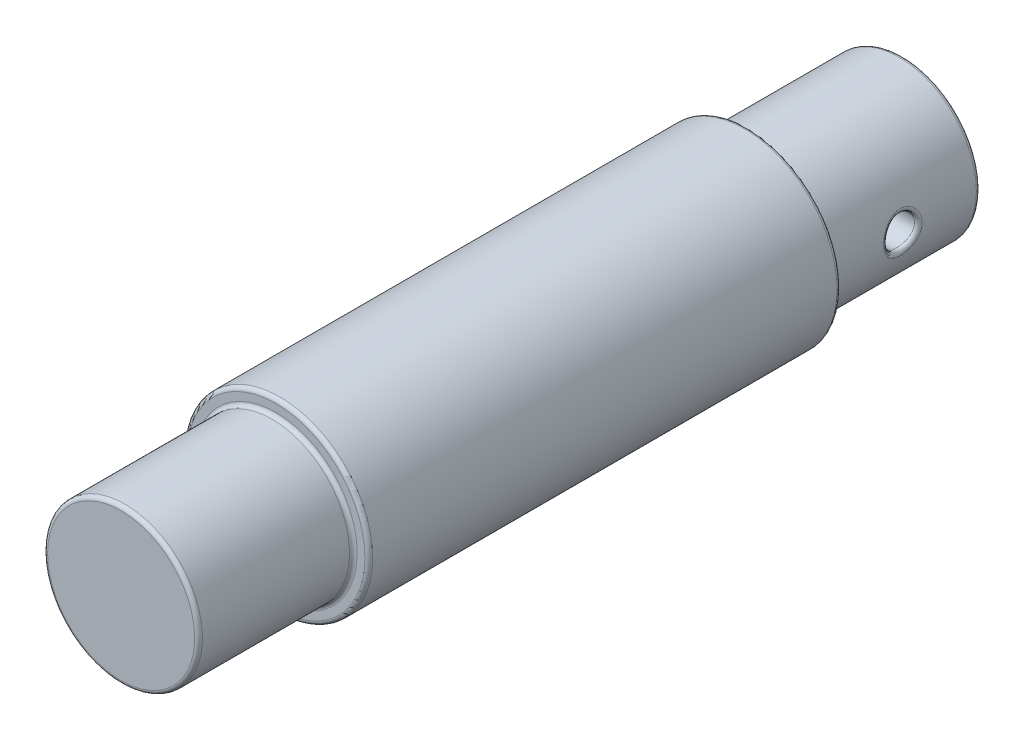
ISO-10303-21;
HEADER;
FILE_DESCRIPTION(('STEP AP214'),'2;1');
FILE_NAME('part.step','',(''),(''),'','','');
FILE_SCHEMA(('AUTOMOTIVE_DESIGN { 1 0 10303 214 1 1 1 1 }'));
ENDSEC;
DATA;
#1=APPLICATION_CONTEXT('core data for automotive mechanical design processes');
#2=APPLICATION_PROTOCOL_DEFINITION('international standard','automotive_design',2000,#1);
#3=PRODUCT_CONTEXT('',#1,'mechanical');
#4=PRODUCT('Part','Part','',(#3));
#5=PRODUCT_RELATED_PRODUCT_CATEGORY('part','',(#4));
#6=PRODUCT_DEFINITION_FORMATION('','',#4);
#7=PRODUCT_DEFINITION_CONTEXT('part definition',#1,'design');
#8=PRODUCT_DEFINITION('design','',#6,#7);
#9=PRODUCT_DEFINITION_SHAPE('','',#8);
#10=(LENGTH_UNIT() NAMED_UNIT(*) SI_UNIT(.MILLI.,.METRE.));
#11=(NAMED_UNIT(*) PLANE_ANGLE_UNIT() SI_UNIT($,.RADIAN.));
#12=(NAMED_UNIT(*) SI_UNIT($,.STERADIAN.) SOLID_ANGLE_UNIT());
#13=UNCERTAINTY_MEASURE_WITH_UNIT(LENGTH_MEASURE(1.E-05),#10,'distance_accuracy_value','');
#14=(GEOMETRIC_REPRESENTATION_CONTEXT(3) GLOBAL_UNCERTAINTY_ASSIGNED_CONTEXT((#13)) GLOBAL_UNIT_ASSIGNED_CONTEXT((#10,
#11,#12)) REPRESENTATION_CONTEXT('',''));
#15=CARTESIAN_POINT('',(0.,0.,0.));
#16=DIRECTION('',(0.,0.,1.));
#17=DIRECTION('',(1.,0.,0.));
#18=AXIS2_PLACEMENT_3D('',#15,#16,#17);
#19=CARTESIAN_POINT('',(0.,0.,50.5));
#20=DIRECTION('',(0.,0.,-1.));
#21=DIRECTION('',(-1.,0.,0.));
#22=AXIS2_PLACEMENT_3D('',#19,#20,#21);
#23=PLANE('',#22);
#24=CARTESIAN_POINT('',(0.,0.,50.5));
#25=DIRECTION('',(0.,0.,-1.));
#26=DIRECTION('',(-1.,0.,0.));
#27=AXIS2_PLACEMENT_3D('',#24,#25,#26);
#28=CIRCLE('',#27,9.5);
#29=CARTESIAN_POINT('',(-9.5,0.,50.5));
#30=VERTEX_POINT('',#29);
#31=EDGE_CURVE('E10',#30,#30,#28,.F.);
#32=ORIENTED_EDGE('',*,*,#31,.T.);
#33=EDGE_LOOP('',(#32));
#34=FACE_BOUND('',#33,.T.);
#35=ADVANCED_FACE('F29',(#34),#23,.F.);
#36=CARTESIAN_POINT('',(0.,0.,50.5));
#37=DIRECTION('',(0.,0.,1.));
#38=DIRECTION('',(1.,0.,0.));
#39=AXIS2_PLACEMENT_3D('',#36,#37,#38);
#40=CYLINDRICAL_SURFACE('',#39,10.);
#41=CARTESIAN_POINT('',(0.,0.,31.));
#42=DIRECTION('',(0.,0.,-1.));
#43=DIRECTION('',(-1.,0.,0.));
#44=AXIS2_PLACEMENT_3D('',#41,#42,#43);
#45=CIRCLE('',#44,10.);
#46=CARTESIAN_POINT('',(-10.,0.,31.));
#47=VERTEX_POINT('',#46);
#48=EDGE_CURVE('E41',#47,#47,#45,.F.);
#49=ORIENTED_EDGE('',*,*,#48,.T.);
#50=EDGE_LOOP('',(#49));
#51=FACE_BOUND('',#50,.T.);
#52=CARTESIAN_POINT('',(0.,0.,50.));
#53=DIRECTION('',(0.,0.,-1.));
#54=DIRECTION('',(-1.,0.,0.));
#55=AXIS2_PLACEMENT_3D('',#52,#53,#54);
#56=CIRCLE('',#55,10.);
#57=CARTESIAN_POINT('',(-10.,0.,50.));
#58=VERTEX_POINT('',#57);
#59=EDGE_CURVE('E46',#58,#58,#56,.T.);
#60=ORIENTED_EDGE('',*,*,#59,.T.);
#61=EDGE_LOOP('',(#60));
#62=FACE_BOUND('',#61,.T.);
#63=ADVANCED_FACE('F117',(#51,#62),#40,.T.);
#64=CARTESIAN_POINT('',(0.,10.,30.5));
#65=DIRECTION('',(0.,0.,-1.));
#66=DIRECTION('',(-1.,0.,0.));
#67=AXIS2_PLACEMENT_3D('',#64,#65,#66);
#68=PLANE('',#67);
#69=CARTESIAN_POINT('',(0.,0.,30.5));
#70=DIRECTION('',(0.,0.,-1.));
#71=DIRECTION('',(-1.,0.,0.));
#72=AXIS2_PLACEMENT_3D('',#69,#70,#71);
#73=CIRCLE('',#72,11.5);
#74=CARTESIAN_POINT('',(-11.5,0.,30.5));
#75=VERTEX_POINT('',#74);
#76=EDGE_CURVE('E135',#75,#75,#73,.F.);
#77=ORIENTED_EDGE('',*,*,#76,.T.);
#78=EDGE_LOOP('',(#77));
#79=FACE_BOUND('',#78,.T.);
#80=CARTESIAN_POINT('',(0.,0.,30.5));
#81=DIRECTION('',(0.,0.,-1.));
#82=DIRECTION('',(-1.,0.,0.));
#83=AXIS2_PLACEMENT_3D('',#80,#81,#82);
#84=CIRCLE('',#83,10.5);
#85=CARTESIAN_POINT('',(-10.5,0.,30.5));
#86=VERTEX_POINT('',#85);
#87=EDGE_CURVE('E173',#86,#86,#84,.T.);
#88=ORIENTED_EDGE('',*,*,#87,.T.);
#89=EDGE_LOOP('',(#88));
#90=FACE_BOUND('',#89,.T.);
#91=ADVANCED_FACE('F122',(#79,#90),#68,.F.);
#92=CARTESIAN_POINT('',(0.,0.,50.5));
#93=DIRECTION('',(0.,0.,1.));
#94=DIRECTION('',(1.,0.,0.));
#95=AXIS2_PLACEMENT_3D('',#92,#93,#94);
#96=CYLINDRICAL_SURFACE('',#95,12.);
#97=CARTESIAN_POINT('',(0.,0.,-30.));
#98=DIRECTION('',(0.,0.,1.));
#99=DIRECTION('',(1.,0.,0.));
#100=AXIS2_PLACEMENT_3D('',#97,#98,#99);
#101=CIRCLE('',#100,12.);
#102=CARTESIAN_POINT('',(12.,0.,-30.));
#103=VERTEX_POINT('',#102);
#104=EDGE_CURVE('E184',#103,#103,#101,.T.);
#105=ORIENTED_EDGE('',*,*,#104,.T.);
#106=EDGE_LOOP('',(#105));
#107=FACE_BOUND('',#106,.T.);
#108=CARTESIAN_POINT('',(0.,0.,30.));
#109=DIRECTION('',(0.,0.,-1.));
#110=DIRECTION('',(-1.,0.,0.));
#111=AXIS2_PLACEMENT_3D('',#108,#109,#110);
#112=CIRCLE('',#111,12.);
#113=CARTESIAN_POINT('',(-12.,0.,30.));
#114=VERTEX_POINT('',#113);
#115=EDGE_CURVE('E187',#114,#114,#112,.T.);
#116=ORIENTED_EDGE('',*,*,#115,.T.);
#117=EDGE_LOOP('',(#116));
#118=FACE_BOUND('',#117,.T.);
#119=ADVANCED_FACE('F191',(#107,#118),#96,.T.);
#120=CARTESIAN_POINT('',(0.,12.,-30.5));
#121=DIRECTION('',(0.,0.,1.));
#122=DIRECTION('',(1.,0.,0.));
#123=AXIS2_PLACEMENT_3D('',#120,#121,#122);
#124=PLANE('',#123);
#125=CARTESIAN_POINT('',(0.,0.,-30.5));
#126=DIRECTION('',(0.,0.,1.));
#127=DIRECTION('',(1.,0.,0.));
#128=AXIS2_PLACEMENT_3D('',#125,#126,#127);
#129=CIRCLE('',#128,11.5);
#130=CARTESIAN_POINT('',(11.5,0.,-30.5));
#131=VERTEX_POINT('',#130);
#132=EDGE_CURVE('E176',#131,#131,#129,.F.);
#133=ORIENTED_EDGE('',*,*,#132,.T.);
#134=EDGE_LOOP('',(#133));
#135=FACE_BOUND('',#134,.T.);
#136=CARTESIAN_POINT('',(0.,0.,-30.5));
#137=DIRECTION('',(0.,0.,1.));
#138=DIRECTION('',(1.,0.,0.));
#139=AXIS2_PLACEMENT_3D('',#136,#137,#138);
#140=CIRCLE('',#139,10.5);
#141=CARTESIAN_POINT('',(10.5,0.,-30.5));
#142=VERTEX_POINT('',#141);
#143=EDGE_CURVE('E179',#142,#142,#140,.T.);
#144=ORIENTED_EDGE('',*,*,#143,.T.);
#145=EDGE_LOOP('',(#144));
#146=FACE_BOUND('',#145,.T.);
#147=ADVANCED_FACE('F199',(#135,#146),#124,.F.);
#148=CARTESIAN_POINT('',(0.,0.,50.5));
#149=DIRECTION('',(0.,0.,1.));
#150=DIRECTION('',(1.,0.,0.));
#151=AXIS2_PLACEMENT_3D('',#148,#149,#150);
#152=CYLINDRICAL_SURFACE('',#151,10.);
#153=CARTESIAN_POINT('',(0.,0.,-50.));
#154=DIRECTION('',(0.,0.,1.));
#155=DIRECTION('',(1.,0.,0.));
#156=AXIS2_PLACEMENT_3D('',#153,#154,#155);
#157=CIRCLE('',#156,10.);
#158=CARTESIAN_POINT('',(10.,0.,-50.));
#159=VERTEX_POINT('',#158);
#160=EDGE_CURVE('E144',#159,#159,#157,.T.);
#161=ORIENTED_EDGE('',*,*,#160,.T.);
#162=EDGE_LOOP('',(#161));
#163=FACE_BOUND('',#162,.T.);
#164=CARTESIAN_POINT('',(0.,0.,-31.));
#165=DIRECTION('',(0.,0.,1.));
#166=DIRECTION('',(1.,0.,0.));
#167=AXIS2_PLACEMENT_3D('',#164,#165,#166);
#168=CIRCLE('',#167,10.);
#169=CARTESIAN_POINT('',(10.,0.,-31.));
#170=VERTEX_POINT('',#169);
#171=EDGE_CURVE('E141',#170,#170,#168,.F.);
#172=ORIENTED_EDGE('',*,*,#171,.T.);
#173=EDGE_LOOP('',(#172));
#174=FACE_BOUND('',#173,.T.);
#175=CARTESIAN_POINT('',(9.4771491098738,0.526813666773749,-42.4293696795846));
#176=CARTESIAN_POINT('',(9.98522321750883,0.559667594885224,-42.4203989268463));
#177=CARTESIAN_POINT('',(9.97594643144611,0.69317587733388,-42.9117120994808));
#178=CARTESIAN_POINT('',(9.48652167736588,0.41889923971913,-42.4588354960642));
#179=CARTESIAN_POINT('',(9.99120303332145,0.446213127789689,-42.4533430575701));
#180=CARTESIAN_POINT('',(9.9858122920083,0.551183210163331,-42.9485443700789));
#181=CARTESIAN_POINT('',(9.49320223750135,0.308363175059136,-42.479261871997));
#182=CARTESIAN_POINT('',(9.9955693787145,0.328566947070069,-42.4765365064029));
#183=CARTESIAN_POINT('',(9.9928444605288,0.405741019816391,-42.9740773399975));
#184=CARTESIAN_POINT('',(9.50042414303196,0.085312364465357,-42.5013184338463));
#185=CARTESIAN_POINT('',(10.0002694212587,0.0911666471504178,-42.50146458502));
#186=CARTESIAN_POINT('',(10.0004464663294,0.112253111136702,-43.0016480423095));
#187=CARTESIAN_POINT('',(9.50096657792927,-0.0272020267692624,-42.5029519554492));
#188=CARTESIAN_POINT('',(10.0006270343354,-0.029164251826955,-42.5033262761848));
#189=CARTESIAN_POINT('',(10.001017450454,-0.0357921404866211,-43.0036899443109));
#190=CARTESIAN_POINT('',(9.49592264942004,-0.247854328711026,-42.4875809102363));
#191=CARTESIAN_POINT('',(9.99734068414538,-0.264162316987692,-42.4859461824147));
#192=CARTESIAN_POINT('',(9.99570805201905,-0.326124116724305,-42.9844761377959));
#193=CARTESIAN_POINT('',(9.49049788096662,-0.356029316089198,-42.4710677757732));
#194=CARTESIAN_POINT('',(9.99378674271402,-0.37945080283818,-42.4671790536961));
#195=CARTESIAN_POINT('',(9.98999776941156,-0.4684596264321,-42.9638347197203));
#196=CARTESIAN_POINT('',(9.47436100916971,-0.568006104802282,-42.4207388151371));
#197=CARTESIAN_POINT('',(9.98340582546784,-0.603684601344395,-42.4105844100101));
#198=CARTESIAN_POINT('',(9.97301158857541,-0.74737645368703,-42.900923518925));
#199=CARTESIAN_POINT('',(9.46364870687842,-0.671807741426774,-42.3869223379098));
#200=CARTESIAN_POINT('',(9.97653454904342,-0.713076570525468,-42.3725073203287));
#201=CARTESIAN_POINT('',(9.96173548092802,-0.883957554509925,-42.8586529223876));
#202=CARTESIAN_POINT('',(9.43798322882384,-0.872899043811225,-42.3027770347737));
#203=CARTESIAN_POINT('',(9.96047175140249,-0.922746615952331,-42.2790154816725));
#204=CARTESIAN_POINT('',(9.93471918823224,-1.1485513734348,-42.7534712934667));
#205=CARTESIAN_POINT('',(9.42300338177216,-0.970142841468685,-42.2523440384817));
#206=CARTESIAN_POINT('',(9.95121211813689,-1.02323169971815,-42.2231379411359));
#207=CARTESIAN_POINT('',(9.91895092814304,-1.27650373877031,-42.6904300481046));
#208=CARTESIAN_POINT('',(9.39039294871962,-1.15492559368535,-42.1364734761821));
#209=CARTESIAN_POINT('',(9.93167298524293,-1.2115491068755,-42.0968234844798));
#210=CARTESIAN_POINT('',(9.88462415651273,-1.51963893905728,-42.5455918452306));
#211=CARTESIAN_POINT('',(9.37276187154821,-1.24246274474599,-42.0710331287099));
#212=CARTESIAN_POINT('',(9.92135420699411,-1.29943737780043,-42.0260183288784));
#213=CARTESIAN_POINT('',(9.86606512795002,-1.63481940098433,-42.4637914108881));
#214=CARTESIAN_POINT('',(9.33612618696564,-1.40812428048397,-41.9246969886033));
#215=CARTESIAN_POINT('',(9.90069143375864,-1.46307379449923,-41.8705960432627));
#216=CARTESIAN_POINT('',(9.82750124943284,-1.85279510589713,-42.2808712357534));
#217=CARTESIAN_POINT('',(9.31709626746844,-1.48588869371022,-41.8433973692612));
#218=CARTESIAN_POINT('',(9.89035437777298,-1.53817500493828,-41.785377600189));
#219=CARTESIAN_POINT('',(9.80746975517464,-1.95511670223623,-42.1792467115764));
#220=CARTESIAN_POINT('',(9.28025140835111,-1.62678572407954,-41.6688243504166));
#221=CARTESIAN_POINT('',(9.87118112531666,-1.67173422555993,-41.6062518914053));
#222=CARTESIAN_POINT('',(9.76868569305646,-2.14050753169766,-41.9610304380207));
#223=CARTESIAN_POINT('',(9.26243644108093,-1.68991867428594,-41.5755512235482));
#224=CARTESIAN_POINT('',(9.86237867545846,-1.7298492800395,-41.5122639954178));
#225=CARTESIAN_POINT('',(9.74993309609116,-2.2235772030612,-41.8444390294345));
#226=CARTESIAN_POINT('',(9.2298914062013,-1.80030187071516,-41.3785116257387));
#227=CARTESIAN_POINT('',(9.8469690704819,-1.82969052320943,-41.317858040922));
#228=CARTESIAN_POINT('',(9.71567516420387,-2.3688182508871,-41.5981395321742));
#229=CARTESIAN_POINT('',(9.21519234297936,-1.84739508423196,-41.2746536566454));
#230=CARTESIAN_POINT('',(9.84044473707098,-1.87082388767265,-41.2175989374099));
#231=CARTESIAN_POINT('',(9.70020246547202,-2.43078300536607,-41.4683170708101));
#232=CARTESIAN_POINT('',(9.19088672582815,-1.92333457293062,-41.0601114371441));
#233=CARTESIAN_POINT('',(9.83000625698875,-1.93636318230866,-41.014060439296));
#234=CARTESIAN_POINT('',(9.67461760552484,-2.53070338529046,-41.2001392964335));
#235=CARTESIAN_POINT('',(9.18127901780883,-1.95218498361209,-40.9494287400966));
#236=CARTESIAN_POINT('',(9.82615012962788,-1.96040069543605,-40.9112547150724));
#237=CARTESIAN_POINT('',(9.66450422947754,-2.56866445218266,-41.0617859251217));
#238=CARTESIAN_POINT('',(9.16854942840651,-1.99010236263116,-40.7276090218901));
#239=CARTESIAN_POINT('',(9.82108906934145,-1.99197258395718,-40.7069850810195));
#240=CARTESIAN_POINT('',(9.65110466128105,-2.61855574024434,-40.7845112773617));
#241=CARTESIAN_POINT('',(9.16525764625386,-1.99968791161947,-40.6165668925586));
#242=CARTESIAN_POINT('',(9.81984615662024,-1.99974315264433,-40.6061653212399));
#243=CARTESIAN_POINT('',(9.64763962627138,-2.63116830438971,-40.6457086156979));
#244=CARTESIAN_POINT('',(9.16505029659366,-2.00029695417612,-40.394436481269));
#245=CARTESIAN_POINT('',(9.81976595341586,-2.00024444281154,-40.4038446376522));
#246=CARTESIAN_POINT('',(9.64742136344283,-2.63196967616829,-40.3680456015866));
#247=CARTESIAN_POINT('',(9.16813390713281,-1.99132284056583,-40.2833482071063));
#248=CARTESIAN_POINT('',(9.82092888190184,-1.99297379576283,-40.3030194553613));
#249=CARTESIAN_POINT('',(9.65066727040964,-2.6201616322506,-40.2291852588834));
#250=CARTESIAN_POINT('',(9.18015929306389,-1.95553515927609,-40.0667921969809));
#251=CARTESIAN_POINT('',(9.825702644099,-1.96319185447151,-40.103707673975));
#252=CARTESIAN_POINT('',(9.66332557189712,-2.57307257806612,-39.9584902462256));
#253=CARTESIAN_POINT('',(9.18897271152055,-1.92911227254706,-39.961254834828));
#254=CARTESIAN_POINT('',(9.82923081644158,-1.9411954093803,-40.0058152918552));
#255=CARTESIAN_POINT('',(9.67260285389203,-2.53830562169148,-39.8265685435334));
#256=CARTESIAN_POINT('',(9.21131163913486,-1.85967420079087,-39.7561317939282));
#257=CARTESIAN_POINT('',(9.83875257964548,-1.88147922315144,-39.8117754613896));
#258=CARTESIAN_POINT('',(9.69611751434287,-2.44693973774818,-39.5701647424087));
#259=CARTESIAN_POINT('',(9.22483762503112,-1.81665733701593,-39.6565467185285));
#260=CARTESIAN_POINT('',(9.84469708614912,-1.84407021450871,-39.716051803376));
#261=CARTESIAN_POINT('',(9.71035539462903,-2.3903386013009,-39.4456833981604));
#262=CARTESIAN_POINT('',(9.25538559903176,-1.71435728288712,-39.4641077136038));
#263=CARTESIAN_POINT('',(9.85897301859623,-1.75214031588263,-39.5272169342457));
#264=CARTESIAN_POINT('',(9.7425111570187,-2.25573326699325,-39.205134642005));
#265=CARTESIAN_POINT('',(9.27246740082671,-1.6547890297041,-39.3714115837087));
#266=CARTESIAN_POINT('',(9.86729284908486,-1.69768832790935,-39.4343723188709));
#267=CARTESIAN_POINT('',(9.7604920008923,-2.17735398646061,-39.0892644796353));
#268=CARTESIAN_POINT('',(9.30810015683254,-1.52137310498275,-39.1971291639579));
#269=CARTESIAN_POINT('',(9.88558251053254,-1.57209232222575,-39.2565750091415));
#270=CARTESIAN_POINT('',(9.79800016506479,-2.00180671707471,-38.8714114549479));
#271=CARTESIAN_POINT('',(9.32665142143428,-1.44752241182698,-39.1155452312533));
#272=CARTESIAN_POINT('',(9.8955162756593,-1.50128297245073,-39.1715845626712));
#273=CARTESIAN_POINT('',(9.81752781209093,-1.90463475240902,-38.769431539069));
#274=CARTESIAN_POINT('',(9.36380582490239,-1.28501530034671,-38.9632823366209));
#275=CARTESIAN_POINT('',(9.91619784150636,-1.34188409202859,-39.0108257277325));
#276=CARTESIAN_POINT('',(9.85663771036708,-1.6908096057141,-38.5791029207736));
#277=CARTESIAN_POINT('',(9.38239390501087,-1.19598197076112,-38.8930027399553));
#278=CARTESIAN_POINT('',(9.92696564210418,-1.25299100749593,-38.9351037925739));
#279=CARTESIAN_POINT('',(9.87620411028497,-1.57366048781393,-38.4912534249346));
#280=CARTESIAN_POINT('',(9.41697116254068,-1.00712465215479,-38.7683865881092));
#281=CARTESIAN_POINT('',(9.94752667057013,-1.06127384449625,-38.7997035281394));
#282=CARTESIAN_POINT('',(9.91260122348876,-1.32516401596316,-38.3354832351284));
#283=CARTESIAN_POINT('',(9.43296161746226,-0.907306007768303,-38.7140421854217));
#284=CARTESIAN_POINT('',(9.95735966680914,-0.958427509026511,-38.7396175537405));
#285=CARTESIAN_POINT('',(9.92943328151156,-1.19382369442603,-38.2675527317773));
#286=CARTESIAN_POINT('',(9.45865786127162,-0.713959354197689,-38.6292186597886));
#287=CARTESIAN_POINT('',(9.9733931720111,-0.757088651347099,-38.6454536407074));
#288=CARTESIAN_POINT('',(9.95648195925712,-0.939420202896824,-38.1615233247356));
#289=CARTESIAN_POINT('',(9.46892634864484,-0.621463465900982,-38.5964813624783));
#290=CARTESIAN_POINT('',(9.97993863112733,-0.659892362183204,-38.6087122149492));
#291=CARTESIAN_POINT('',(9.96729089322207,-0.817715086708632,-38.1206017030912));
#292=CARTESIAN_POINT('',(9.48534535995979,-0.432469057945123,-38.5448626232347));
#293=CARTESIAN_POINT('',(9.99045572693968,-0.460430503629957,-38.5507768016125));
#294=CARTESIAN_POINT('',(9.98457406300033,-0.569038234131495,-38.0560782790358));
#295=CARTESIAN_POINT('',(9.49149682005,-0.3359714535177,-38.5259780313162));
#296=CARTESIAN_POINT('',(9.99446273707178,-0.357863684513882,-38.5293785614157));
#297=CARTESIAN_POINT('',(9.99104928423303,-0.442067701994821,-38.0324725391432));
#298=CARTESIAN_POINT('',(9.49958450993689,-0.129832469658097,-38.5012202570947));
#299=CARTESIAN_POINT('',(9.9997181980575,-0.138635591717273,-38.5014206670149));
#300=CARTESIAN_POINT('',(9.99956264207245,-0.170832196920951,-38.0015253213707));
#301=CARTESIAN_POINT('',(9.5009514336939,-0.0199609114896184,-38.4971030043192));
#302=CARTESIAN_POINT('',(10.0006194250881,-0.0211707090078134,-38.4967275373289));
#303=CARTESIAN_POINT('',(10.0010015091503,-0.0262643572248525,-37.996378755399));
#304=CARTESIAN_POINT('',(9.49773132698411,0.198941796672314,-38.5069032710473));
#305=CARTESIAN_POINT('',(9.99851977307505,0.212059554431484,-38.5078125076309));
#306=CARTESIAN_POINT('',(9.99761192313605,0.261765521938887,-38.0086290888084));
#307=CARTESIAN_POINT('',(9.4931422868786,0.307972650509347,-38.5208268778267));
#308=CARTESIAN_POINT('',(9.99550751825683,0.328378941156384,-38.5236504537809));
#309=CARTESIAN_POINT('',(9.99278135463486,0.405227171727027,-38.0260335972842));
#310=CARTESIAN_POINT('',(9.47851419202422,0.521967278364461,-38.566220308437));
#311=CARTESIAN_POINT('',(9.98607098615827,0.555080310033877,-38.574757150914));
#312=CARTESIAN_POINT('',(9.97738335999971,0.686799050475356,-38.0827753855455));
#313=CARTESIAN_POINT('',(9.46847981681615,0.626934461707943,-38.597675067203));
#314=CARTESIAN_POINT('',(9.97960824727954,0.665939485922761,-38.6102390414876));
#315=CARTESIAN_POINT('',(9.96682085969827,0.82491376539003,-38.1220938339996));
#316=CARTESIAN_POINT('',(9.44403198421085,0.830053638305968,-38.6771154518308));
#317=CARTESIAN_POINT('',(9.96423263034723,0.878264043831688,-38.6986900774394));
#318=CARTESIAN_POINT('',(9.94108629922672,1.09217583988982,-38.2213943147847));
#319=CARTESIAN_POINT('',(9.42961821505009,0.928205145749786,-38.7251022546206));
#320=CARTESIAN_POINT('',(9.9552656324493,0.980032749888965,-38.75200540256));
#321=CARTESIAN_POINT('',(9.9259139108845,1.22132256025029,-38.2813778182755));
#322=CARTESIAN_POINT('',(9.39766791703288,1.11662061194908,-38.8370655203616));
#323=CARTESIAN_POINT('',(9.93597819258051,1.17281408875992,-38.8744663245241));
#324=CARTESIAN_POINT('',(9.89228201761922,1.4692376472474,-38.4213319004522));
#325=CARTESIAN_POINT('',(9.38008698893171,1.2067409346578,-38.9012753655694));
#326=CARTESIAN_POINT('',(9.92559717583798,1.26371220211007,-38.9442110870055));
#327=CARTESIAN_POINT('',(9.87377577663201,1.58781701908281,-38.5015942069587));
#328=CARTESIAN_POINT('',(9.34381245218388,1.37511449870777,-39.0435613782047));
#329=CARTESIAN_POINT('',(9.90495390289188,1.4307784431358,-39.095895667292));
#330=CARTESIAN_POINT('',(9.83559205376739,1.80936118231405,-38.6794517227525));
#331=CARTESIAN_POINT('',(9.32511869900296,1.45336619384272,-39.1216393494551));
#332=CARTESIAN_POINT('',(9.89468014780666,1.50681296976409,-39.1781350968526));
#333=CARTESIAN_POINT('',(9.81591441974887,1.91232393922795,-38.7770491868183));
#334=CARTESIAN_POINT('',(9.28811744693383,1.59792305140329,-39.2919263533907));
#335=CARTESIAN_POINT('',(9.8751722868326,1.64476491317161,-39.3538547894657));
#336=CARTESIAN_POINT('',(9.77696573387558,2.10253033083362,-38.989907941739));
#337=CARTESIAN_POINT('',(9.26983344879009,1.66385507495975,-39.3844560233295));
#338=CARTESIAN_POINT('',(9.86600633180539,1.70589388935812,-39.4476547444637));
#339=CARTESIAN_POINT('',(9.75771941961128,2.18928299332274,-39.1055700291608));
#340=CARTESIAN_POINT('',(9.23629165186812,1.7792443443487,-39.5796003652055));
#341=CARTESIAN_POINT('',(9.84990781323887,1.81095566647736,-39.6412539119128));
#342=CARTESIAN_POINT('',(9.72241226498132,2.34111097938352,-39.3495004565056));
#343=CARTESIAN_POINT('',(9.22103368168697,1.82870252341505,-39.682214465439));
#344=CARTESIAN_POINT('',(9.84303326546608,1.85446678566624,-39.7408953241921));
#345=CARTESIAN_POINT('',(9.70635124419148,2.40618753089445,-39.4777680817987));
#346=CARTESIAN_POINT('',(9.19548557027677,1.90926000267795,-39.8938343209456));
#347=CARTESIAN_POINT('',(9.83192056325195,1.92440887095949,-39.9426700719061));
#348=CARTESIAN_POINT('',(9.67945849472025,2.51218421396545,-39.742292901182));
#349=CARTESIAN_POINT('',(9.18515593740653,1.94050570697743,-40.0027811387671));
#350=CARTESIAN_POINT('',(9.82771995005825,1.95060127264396,-40.0443579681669));
#351=CARTESIAN_POINT('',(9.66858519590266,2.55329698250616,-39.8784764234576));
#352=CARTESIAN_POINT('',(9.17056934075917,1.98417310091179,-40.2246282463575));
#353=CARTESIAN_POINT('',(9.82186730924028,1.98711615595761,-40.2493598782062));
#354=CARTESIAN_POINT('',(9.65323088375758,2.61075407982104,-40.1557853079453));
#355=CARTESIAN_POINT('',(9.16631088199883,1.99659942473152,-40.3375275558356));
#356=CARTESIAN_POINT('',(9.82025230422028,1.9972078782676,-40.3520446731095));
#357=CARTESIAN_POINT('',(9.648748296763,2.62710450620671,-40.296909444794));
#358=CARTESIAN_POINT('',(9.16443703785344,2.00209485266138,-40.560213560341));
#359=CARTESIAN_POINT('',(9.81952921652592,2.00172163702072,-40.5549178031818));
#360=CARTESIAN_POINT('',(9.6467758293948,2.63433533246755,-40.5752669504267));
#361=CARTESIAN_POINT('',(9.16661405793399,1.99576884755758,-40.6699846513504));
#362=CARTESIAN_POINT('',(9.8203475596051,1.99660357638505,-40.6544260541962));
#363=CARTESIAN_POINT('',(9.64906742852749,2.62601164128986,-40.7124808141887));
#364=CARTESIAN_POINT('',(9.17689831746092,1.96528586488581,-40.8868327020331));
#365=CARTESIAN_POINT('',(9.82439937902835,1.97132496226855,-40.8534413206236));
#366=CARTESIAN_POINT('',(9.65989296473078,2.58590245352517,-40.9835408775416));
#367=CARTESIAN_POINT('',(9.18500550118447,1.94112905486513,-40.9939096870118));
#368=CARTESIAN_POINT('',(9.82760762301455,1.95132169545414,-40.9523406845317));
#369=CARTESIAN_POINT('',(9.66842684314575,2.55411717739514,-41.1173871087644));
#370=CARTESIAN_POINT('',(9.20613805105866,1.87595582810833,-41.2018592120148));
#371=CARTESIAN_POINT('',(9.83651059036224,1.89557818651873,-41.1481578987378));
#372=CARTESIAN_POINT('',(9.69067163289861,2.46836293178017,-41.3773240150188));
#373=CARTESIAN_POINT('',(9.21913847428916,1.83502482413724,-41.3027602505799));
#374=CARTESIAN_POINT('',(9.84214464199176,1.86022044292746,-41.2446218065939));
#375=CARTESIAN_POINT('',(9.70435628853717,2.41450634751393,-41.5034503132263));
#376=CARTESIAN_POINT('',(9.24860425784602,1.73753534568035,-41.4963544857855));
#377=CARTESIAN_POINT('',(9.85573884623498,1.77315246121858,-41.4336183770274));
#378=CARTESIAN_POINT('',(9.73537290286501,2.28623071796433,-41.7454431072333));
#379=CARTESIAN_POINT('',(9.26507021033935,1.68097419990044,-41.5890462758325));
#380=CARTESIAN_POINT('',(9.8636450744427,1.72180812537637,-41.5259133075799));
#381=CARTESIAN_POINT('',(9.7527054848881,2.21180815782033,-41.8613078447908));
#382=CARTESIAN_POINT('',(9.30022176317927,1.55185130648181,-41.7665533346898));
#383=CARTESIAN_POINT('',(9.88144554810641,1.60108984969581,-41.7059513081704));
#384=CARTESIAN_POINT('',(9.78970711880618,2.04190961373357,-42.0831916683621));
#385=CARTESIAN_POINT('',(9.31895879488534,1.47886390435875,-41.8510525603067));
#386=CARTESIAN_POINT('',(9.89135443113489,1.53155816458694,-41.79352532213));
#387=CARTESIAN_POINT('',(9.80943030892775,1.94587355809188,-42.1888157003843));
#388=CARTESIAN_POINT('',(9.35619155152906,1.31985118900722,-42.0067777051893));
#389=CARTESIAN_POINT('',(9.91187810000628,1.37634684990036,-41.9572749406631));
#390=CARTESIAN_POINT('',(9.84862268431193,1.73664630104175,-42.3834721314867));
#391=CARTESIAN_POINT('',(9.37468726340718,1.23382517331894,-42.0780029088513));
#392=CARTESIAN_POINT('',(9.92248685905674,1.29089089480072,-42.0336830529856));
#393=CARTESIAN_POINT('',(9.86809185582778,1.6234541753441,-42.4725036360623));
#394=CARTESIAN_POINT('',(9.40977131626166,1.04920715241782,-42.2064708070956));
#395=CARTESIAN_POINT('',(9.94317255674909,1.10432278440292,-42.1727423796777));
#396=CARTESIAN_POINT('',(9.90502243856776,1.38053572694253,-42.6330885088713));
#397=CARTESIAN_POINT('',(9.42631752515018,0.950410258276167,-42.2634271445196));
#398=CARTESIAN_POINT('',(9.95327319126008,1.00292813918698,-42.2355186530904));
#399=CARTESIAN_POINT('',(9.92243950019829,1.2505398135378,-42.7042839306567));
#400=CARTESIAN_POINT('',(9.45522556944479,0.744255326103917,-42.3598460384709));
#401=CARTESIAN_POINT('',(9.97119497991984,0.789041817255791,-42.3422035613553));
#402=CARTESIAN_POINT('',(9.95286902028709,0.979283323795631,-42.8248075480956));
#403=CARTESIAN_POINT('',(9.46758803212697,0.636898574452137,-42.3993112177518));
#404=CARTESIAN_POINT('',(9.97907600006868,0.676298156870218,-42.3865325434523));
#405=CARTESIAN_POINT('',(9.96588213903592,0.838024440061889,-42.8741390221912));
#406=CARTESIAN_POINT('',(9.4771491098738,0.526813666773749,-42.4293696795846));
#407=CARTESIAN_POINT('',(9.98522321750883,0.559667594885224,-42.4203989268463));
#408=CARTESIAN_POINT('',(9.97594643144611,0.69317587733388,-42.9117120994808));
#409=(BOUNDED_SURFACE() B_SPLINE_SURFACE(3,2,((#175,#176,#177),(#178,#179,#180),(#181,#182,
#183),(#184,#185,#186),(#187,#188,#189),(#190,#191,#192),(#193,#194,#195),(#196,#197,#198),
(#199,#200,#201),(#202,#203,#204),(#205,#206,#207),(#208,#209,#210),(#211,#212,#213),(#214,#215,
#216),(#217,#218,#219),(#220,#221,#222),(#223,#224,#225),(#226,#227,#228),(#229,#230,#231),
(#232,#233,#234),(#235,#236,#237),(#238,#239,#240),(#241,#242,#243),(#244,#245,#246),(#247,#248,
#249),(#250,#251,#252),(#253,#254,#255),(#256,#257,#258),(#259,#260,#261),(#262,#263,#264),
(#265,#266,#267),(#268,#269,#270),(#271,#272,#273),(#274,#275,#276),(#277,#278,#279),(#280,#281,
#282),(#283,#284,#285),(#286,#287,#288),(#289,#290,#291),(#292,#293,#294),(#295,#296,#297),
(#298,#299,#300),(#301,#302,#303),(#304,#305,#306),(#307,#308,#309),(#310,#311,#312),(#313,#314,
#315),(#316,#317,#318),(#319,#320,#321),(#322,#323,#324),(#325,#326,#327),(#328,#329,#330),
(#331,#332,#333),(#334,#335,#336),(#337,#338,#339),(#340,#341,#342),(#343,#344,#345),(#346,#347,
#348),(#349,#350,#351),(#352,#353,#354),(#355,#356,#357),(#358,#359,#360),(#361,#362,#363),
(#364,#365,#366),(#367,#368,#369),(#370,#371,#372),(#373,#374,#375),(#376,#377,#378),(#379,#380,
#381),(#382,#383,#384),(#385,#386,#387),(#388,#389,#390),(#391,#392,#393),(#394,#395,#396),
(#397,#398,#399),(#400,#401,#402),(#403,#404,#405),(#406,#407,#408)),.UNSPECIFIED.,.T.,.F.,
.F.) B_SPLINE_SURFACE_WITH_KNOTS((4,2,2,2,2,2,2,2,2,2,2,2,2,2,2,2,2,2,2,2,2,2,2,2,2,2,2,2,2,2,2,
2,2,2,2,2,2,2,4),(3,3),(0.,0.419913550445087,0.839752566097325,1.24849594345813,
1.65725470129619,2.06862637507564,2.48007435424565,2.9038322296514,3.32758045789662,
3.75536543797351,4.18305340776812,4.59906562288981,5.01502420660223,5.421971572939,
5.82896011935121,6.24344629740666,6.65802026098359,7.08499969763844,7.51176850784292,
7.87965763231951,8.24746307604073,8.65777516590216,9.0682257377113,9.47832413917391,
9.88845174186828,10.3048535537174,10.7213095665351,11.148843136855,11.576352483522,
12.0003760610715,12.4242952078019,12.8346904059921,13.2450817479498,13.6534088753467,
14.0618058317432,14.4823427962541,14.9029024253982,15.3313259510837,15.7596852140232),(0.,1.),
.UNSPECIFIED.) GEOMETRIC_REPRESENTATION_ITEM() RATIONAL_B_SPLINE_SURFACE(((1.,0.700621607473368,
1.),(1.,0.703290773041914,1.),(1.,0.705182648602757,1.),(1.,0.707227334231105,1.),(1.,
0.707380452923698,1.),(1.,0.705953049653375,1.),(1.,0.70441823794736,1.),(1.,0.69982999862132,
1.),(1.,0.696776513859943,1.),(1.,0.689408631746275,1.),(1.,0.685086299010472,1.),(1.,
0.675593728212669,1.),(1.,0.670423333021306,1.),(1.,0.659574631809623,1.),(1.,0.653885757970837,
1.),(1.,0.642760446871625,1.),(1.,0.637324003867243,1.),(1.,0.627305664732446,1.),(1.,
0.62273240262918,1.),(1.,0.615124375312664,1.),(1.,0.612089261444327,1.),(1.,0.608059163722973,
1.),(1.,0.607010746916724,1.),(1.,0.606944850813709,1.),(1.,0.607927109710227,1.),(1.,
0.611735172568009,1.),(1.,0.614520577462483,1.),(1.,0.621521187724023,1.),(1.,0.625736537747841,
1.),(1.,0.635162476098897,1.),(1.,0.640389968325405,1.),(1.,0.651181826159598,1.),(1.,
0.656746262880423,1.),(1.,0.667784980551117,1.),(1.,0.673251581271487,1.),(1.,0.683339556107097,
1.),(1.,0.687961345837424,1.),(1.,0.695347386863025,1.),(1.,0.698279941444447,1.),(1.,
0.702955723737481,1.),(1.,0.704699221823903,1.),(1.,0.706990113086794,1.),(1.,0.707375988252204,
1.),(1.,0.70646496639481,1.),(1.,0.705167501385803,1.),(1.,0.701012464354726,1.),(1.,
0.698156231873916,1.),(1.,0.691149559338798,1.),(1.,0.686999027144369,1.),(1.,0.677719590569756,
1.),(1.,0.672576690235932,1.),(1.,0.661861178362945,1.),(1.,0.656288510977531,1.),(1.,
0.645148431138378,1.),(1.,0.639585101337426,1.),(1.,0.629286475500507,1.),(1.,0.62455113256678,
1.),(1.,0.616570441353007,1.),(1.,0.613313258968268,1.),(1.,0.608701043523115,1.),(1.,
0.607345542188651,1.),(1.,0.606749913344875,1.),(1.,0.607443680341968,1.),(1.,0.610703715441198,
1.),(1.,0.613269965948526,1.),(1.,0.619904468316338,1.),(1.,0.623965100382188,1.),(1.,
0.633078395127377,1.),(1.,0.638131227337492,1.),(1.,0.648807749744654,1.),(1.,0.654443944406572,
1.),(1.,0.665534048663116,1.),(1.,0.670987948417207,1.),(1.,0.681249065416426,1.),(1.,
0.686042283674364,1.),(1.,0.694367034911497,1.),(1.,0.697898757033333,1.),(1.,0.700621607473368,1.))) REPRESENTATION_ITEM('') SURFACE());
#410=CARTESIAN_POINT('',(9.97594643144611,0.69317587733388,-42.9117120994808));
#411=CARTESIAN_POINT('',(9.9858122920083,0.551183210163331,-42.9485443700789));
#412=CARTESIAN_POINT('',(9.9928444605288,0.405741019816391,-42.9740773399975));
#413=CARTESIAN_POINT('',(10.0004464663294,0.112253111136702,-43.0016480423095));
#414=CARTESIAN_POINT('',(10.001017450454,-0.0357921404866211,-43.0036899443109));
#415=CARTESIAN_POINT('',(9.99570805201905,-0.326124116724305,-42.9844761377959));
#416=CARTESIAN_POINT('',(9.98999776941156,-0.4684596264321,-42.9638347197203));
#417=CARTESIAN_POINT('',(9.97301158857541,-0.74737645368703,-42.900923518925));
#418=CARTESIAN_POINT('',(9.96173548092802,-0.883957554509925,-42.8586529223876));
#419=CARTESIAN_POINT('',(9.93471918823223,-1.1485513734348,-42.7534712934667));
#420=CARTESIAN_POINT('',(9.91895092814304,-1.27650373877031,-42.6904300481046));
#421=CARTESIAN_POINT('',(9.88462415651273,-1.51963893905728,-42.5455918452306));
#422=CARTESIAN_POINT('',(9.86606512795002,-1.63481940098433,-42.4637914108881));
#423=CARTESIAN_POINT('',(9.82750124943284,-1.85279510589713,-42.2808712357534));
#424=CARTESIAN_POINT('',(9.80746975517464,-1.95511670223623,-42.1792467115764));
#425=CARTESIAN_POINT('',(9.76868569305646,-2.14050753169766,-41.9610304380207));
#426=CARTESIAN_POINT('',(9.74993309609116,-2.2235772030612,-41.8444390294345));
#427=CARTESIAN_POINT('',(9.71567516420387,-2.3688182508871,-41.5981395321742));
#428=CARTESIAN_POINT('',(9.70020246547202,-2.43078300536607,-41.4683170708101));
#429=CARTESIAN_POINT('',(9.67461760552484,-2.53070338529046,-41.2001392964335));
#430=CARTESIAN_POINT('',(9.66450422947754,-2.56866445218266,-41.0617859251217));
#431=CARTESIAN_POINT('',(9.65110466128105,-2.61855574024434,-40.7845112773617));
#432=CARTESIAN_POINT('',(9.64763962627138,-2.63116830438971,-40.6457086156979));
#433=CARTESIAN_POINT('',(9.64742136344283,-2.63196967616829,-40.3680456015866));
#434=CARTESIAN_POINT('',(9.65066727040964,-2.6201616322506,-40.2291852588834));
#435=CARTESIAN_POINT('',(9.66332557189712,-2.57307257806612,-39.9584902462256));
#436=CARTESIAN_POINT('',(9.67260285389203,-2.53830562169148,-39.8265685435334));
#437=CARTESIAN_POINT('',(9.69611751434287,-2.44693973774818,-39.5701647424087));
#438=CARTESIAN_POINT('',(9.71035539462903,-2.3903386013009,-39.4456833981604));
#439=CARTESIAN_POINT('',(9.7425111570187,-2.25573326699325,-39.205134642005));
#440=CARTESIAN_POINT('',(9.7604920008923,-2.17735398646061,-39.0892644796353));
#441=CARTESIAN_POINT('',(9.79800016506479,-2.00180671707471,-38.8714114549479));
#442=CARTESIAN_POINT('',(9.81752781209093,-1.90463475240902,-38.769431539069));
#443=CARTESIAN_POINT('',(9.85663771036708,-1.6908096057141,-38.5791029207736));
#444=CARTESIAN_POINT('',(9.87620411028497,-1.57366048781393,-38.4912534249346));
#445=CARTESIAN_POINT('',(9.91260122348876,-1.32516401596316,-38.3354832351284));
#446=CARTESIAN_POINT('',(9.92943328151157,-1.19382369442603,-38.2675527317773));
#447=CARTESIAN_POINT('',(9.95648195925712,-0.939420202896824,-38.1615233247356));
#448=CARTESIAN_POINT('',(9.96729089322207,-0.817715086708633,-38.1206017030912));
#449=CARTESIAN_POINT('',(9.98457406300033,-0.569038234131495,-38.0560782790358));
#450=CARTESIAN_POINT('',(9.99104928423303,-0.442067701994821,-38.0324725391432));
#451=CARTESIAN_POINT('',(9.99956264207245,-0.17083219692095,-38.0015253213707));
#452=CARTESIAN_POINT('',(10.0010015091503,-0.0262643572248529,-37.996378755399));
#453=CARTESIAN_POINT('',(9.99761192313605,0.261765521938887,-38.0086290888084));
#454=CARTESIAN_POINT('',(9.99278135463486,0.405227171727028,-38.0260335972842));
#455=CARTESIAN_POINT('',(9.97738335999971,0.686799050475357,-38.0827753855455));
#456=CARTESIAN_POINT('',(9.96682085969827,0.82491376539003,-38.1220938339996));
#457=CARTESIAN_POINT('',(9.94108629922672,1.09217583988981,-38.2213943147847));
#458=CARTESIAN_POINT('',(9.9259139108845,1.22132256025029,-38.2813778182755));
#459=CARTESIAN_POINT('',(9.89228201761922,1.4692376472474,-38.4213319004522));
#460=CARTESIAN_POINT('',(9.87377577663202,1.58781701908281,-38.5015942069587));
#461=CARTESIAN_POINT('',(9.83559205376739,1.80936118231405,-38.6794517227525));
#462=CARTESIAN_POINT('',(9.81591441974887,1.91232393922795,-38.7770491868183));
#463=CARTESIAN_POINT('',(9.77696573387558,2.10253033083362,-38.989907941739));
#464=CARTESIAN_POINT('',(9.75771941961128,2.18928299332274,-39.1055700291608));
#465=CARTESIAN_POINT('',(9.72241226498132,2.34111097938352,-39.3495004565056));
#466=CARTESIAN_POINT('',(9.70635124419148,2.40618753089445,-39.4777680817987));
#467=CARTESIAN_POINT('',(9.67945849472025,2.51218421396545,-39.742292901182));
#468=CARTESIAN_POINT('',(9.66858519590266,2.55329698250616,-39.8784764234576));
#469=CARTESIAN_POINT('',(9.65323088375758,2.61075407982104,-40.1557853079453));
#470=CARTESIAN_POINT('',(9.648748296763,2.62710450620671,-40.296909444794));
#471=CARTESIAN_POINT('',(9.6467758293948,2.63433533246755,-40.5752669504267));
#472=CARTESIAN_POINT('',(9.64906742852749,2.62601164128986,-40.7124808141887));
#473=CARTESIAN_POINT('',(9.65989296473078,2.58590245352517,-40.9835408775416));
#474=CARTESIAN_POINT('',(9.66842684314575,2.55411717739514,-41.1173871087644));
#475=CARTESIAN_POINT('',(9.69067163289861,2.46836293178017,-41.3773240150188));
#476=CARTESIAN_POINT('',(9.70435628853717,2.41450634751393,-41.5034503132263));
#477=CARTESIAN_POINT('',(9.73537290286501,2.28623071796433,-41.7454431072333));
#478=CARTESIAN_POINT('',(9.7527054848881,2.21180815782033,-41.8613078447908));
#479=CARTESIAN_POINT('',(9.78970711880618,2.04190961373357,-42.0831916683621));
#480=CARTESIAN_POINT('',(9.80943030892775,1.94587355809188,-42.1888157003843));
#481=CARTESIAN_POINT('',(9.84862268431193,1.73664630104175,-42.3834721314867));
#482=CARTESIAN_POINT('',(9.86809185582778,1.6234541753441,-42.4725036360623));
#483=CARTESIAN_POINT('',(9.90502243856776,1.38053572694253,-42.6330885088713));
#484=CARTESIAN_POINT('',(9.92243950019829,1.2505398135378,-42.7042839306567));
#485=CARTESIAN_POINT('',(9.95286902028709,0.979283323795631,-42.8248075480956));
#486=CARTESIAN_POINT('',(9.96588213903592,0.838024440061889,-42.8741390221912));
#487=CARTESIAN_POINT('',(9.97594643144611,0.69317587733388,-42.9117120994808));
#488=B_SPLINE_CURVE_WITH_KNOTS('',3,(#410,#411,#412,#413,#414,#415,#416,#417,#418,#419,#420,
#421,#422,#423,#424,#425,#426,#427,#428,#429,#430,#431,#432,#433,#434,#435,#436,#437,#438,#439,
#440,#441,#442,#443,#444,#445,#446,#447,#448,#449,#450,#451,#452,#453,#454,#455,#456,#457,#458,
#459,#460,#461,#462,#463,#464,#465,#466,#467,#468,#469,#470,#471,#472,#473,#474,#475,#476,#477,
#478,#479,#480,#481,#482,#483,#484,#485,#486,#487),.UNSPECIFIED.,.T.,.F.,(4,2,2,2,2,2,2,2,2,2,2,
2,2,2,2,2,2,2,2,2,2,2,2,2,2,2,2,2,2,2,2,2,2,2,2,2,2,2,4),(0.,0.419913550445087,
0.839752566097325,1.24849594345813,1.65725470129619,2.06862637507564,2.48007435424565,
2.9038322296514,3.32758045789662,3.75536543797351,4.18305340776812,4.59906562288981,
5.01502420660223,5.421971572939,5.82896011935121,6.24344629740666,6.65802026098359,
7.08499969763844,7.51176850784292,7.87965763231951,8.24746307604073,8.65777516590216,
9.0682257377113,9.47832413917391,9.88845174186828,10.3048535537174,10.7213095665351,
11.148843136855,11.576352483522,12.0003760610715,12.4242952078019,12.8346904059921,
13.2450817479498,13.6534088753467,14.0618058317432,14.4823427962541,14.9029024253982,
15.3313259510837,15.7596852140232),.UNSPECIFIED.);
#489=CARTESIAN_POINT('',(9.97594643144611,0.69317587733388,-42.9117120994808));
#490=VERTEX_POINT('',#489);
#491=EDGE_CURVE('E134',#490,#490,#488,.T.);
#492=ORIENTED_EDGE('',*,*,#491,.T.);
#493=EDGE_LOOP('',(#492));
#494=FACE_BOUND('',#493,.T.);
#495=CARTESIAN_POINT('',(-9.4771491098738,-0.526813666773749,-42.4293696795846));
#496=CARTESIAN_POINT('',(-9.98522321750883,-0.559667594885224,-42.4203989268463));
#497=CARTESIAN_POINT('',(-9.97594643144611,-0.69317587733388,-42.9117120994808));
#498=CARTESIAN_POINT('',(-9.48652167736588,-0.41889923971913,-42.4588354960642));
#499=CARTESIAN_POINT('',(-9.99120303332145,-0.446213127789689,-42.4533430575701));
#500=CARTESIAN_POINT('',(-9.9858122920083,-0.551183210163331,-42.9485443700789));
#501=CARTESIAN_POINT('',(-9.49320223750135,-0.308363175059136,-42.479261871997));
#502=CARTESIAN_POINT('',(-9.9955693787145,-0.328566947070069,-42.4765365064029));
#503=CARTESIAN_POINT('',(-9.9928444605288,-0.405741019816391,-42.9740773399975));
#504=CARTESIAN_POINT('',(-9.50042414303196,-0.085312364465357,-42.5013184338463));
#505=CARTESIAN_POINT('',(-10.0002694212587,-0.0911666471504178,-42.50146458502));
#506=CARTESIAN_POINT('',(-10.0004464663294,-0.112253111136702,-43.0016480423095));
#507=CARTESIAN_POINT('',(-9.50096657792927,0.0272020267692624,-42.5029519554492));
#508=CARTESIAN_POINT('',(-10.0006270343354,0.029164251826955,-42.5033262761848));
#509=CARTESIAN_POINT('',(-10.001017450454,0.0357921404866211,-43.0036899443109));
#510=CARTESIAN_POINT('',(-9.49592264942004,0.247854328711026,-42.4875809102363));
#511=CARTESIAN_POINT('',(-9.99734068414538,0.264162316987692,-42.4859461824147));
#512=CARTESIAN_POINT('',(-9.99570805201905,0.326124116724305,-42.9844761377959));
#513=CARTESIAN_POINT('',(-9.49049788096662,0.356029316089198,-42.4710677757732));
#514=CARTESIAN_POINT('',(-9.99378674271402,0.37945080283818,-42.4671790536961));
#515=CARTESIAN_POINT('',(-9.98999776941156,0.4684596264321,-42.9638347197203));
#516=CARTESIAN_POINT('',(-9.47436100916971,0.568006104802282,-42.4207388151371));
#517=CARTESIAN_POINT('',(-9.98340582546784,0.603684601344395,-42.4105844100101));
#518=CARTESIAN_POINT('',(-9.97301158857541,0.74737645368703,-42.900923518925));
#519=CARTESIAN_POINT('',(-9.46364870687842,0.671807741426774,-42.3869223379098));
#520=CARTESIAN_POINT('',(-9.97653454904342,0.713076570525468,-42.3725073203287));
#521=CARTESIAN_POINT('',(-9.96173548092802,0.883957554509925,-42.8586529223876));
#522=CARTESIAN_POINT('',(-9.43798322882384,0.872899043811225,-42.3027770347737));
#523=CARTESIAN_POINT('',(-9.96047175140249,0.922746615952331,-42.2790154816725));
#524=CARTESIAN_POINT('',(-9.93471918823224,1.1485513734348,-42.7534712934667));
#525=CARTESIAN_POINT('',(-9.42300338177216,0.970142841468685,-42.2523440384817));
#526=CARTESIAN_POINT('',(-9.95121211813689,1.02323169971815,-42.2231379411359));
#527=CARTESIAN_POINT('',(-9.91895092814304,1.27650373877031,-42.6904300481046));
#528=CARTESIAN_POINT('',(-9.39039294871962,1.15492559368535,-42.1364734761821));
#529=CARTESIAN_POINT('',(-9.93167298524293,1.2115491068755,-42.0968234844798));
#530=CARTESIAN_POINT('',(-9.88462415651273,1.51963893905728,-42.5455918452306));
#531=CARTESIAN_POINT('',(-9.37276187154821,1.24246274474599,-42.0710331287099));
#532=CARTESIAN_POINT('',(-9.92135420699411,1.29943737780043,-42.0260183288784));
#533=CARTESIAN_POINT('',(-9.86606512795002,1.63481940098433,-42.4637914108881));
#534=CARTESIAN_POINT('',(-9.33612618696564,1.40812428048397,-41.9246969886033));
#535=CARTESIAN_POINT('',(-9.90069143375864,1.46307379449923,-41.8705960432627));
#536=CARTESIAN_POINT('',(-9.82750124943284,1.85279510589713,-42.2808712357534));
#537=CARTESIAN_POINT('',(-9.31709626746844,1.48588869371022,-41.8433973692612));
#538=CARTESIAN_POINT('',(-9.89035437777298,1.53817500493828,-41.785377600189));
#539=CARTESIAN_POINT('',(-9.80746975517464,1.95511670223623,-42.1792467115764));
#540=CARTESIAN_POINT('',(-9.28025140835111,1.62678572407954,-41.6688243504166));
#541=CARTESIAN_POINT('',(-9.87118112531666,1.67173422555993,-41.6062518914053));
#542=CARTESIAN_POINT('',(-9.76868569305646,2.14050753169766,-41.9610304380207));
#543=CARTESIAN_POINT('',(-9.26243644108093,1.68991867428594,-41.5755512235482));
#544=CARTESIAN_POINT('',(-9.86237867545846,1.7298492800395,-41.5122639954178));
#545=CARTESIAN_POINT('',(-9.74993309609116,2.2235772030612,-41.8444390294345));
#546=CARTESIAN_POINT('',(-9.2298914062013,1.80030187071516,-41.3785116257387));
#547=CARTESIAN_POINT('',(-9.8469690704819,1.82969052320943,-41.317858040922));
#548=CARTESIAN_POINT('',(-9.71567516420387,2.3688182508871,-41.5981395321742));
#549=CARTESIAN_POINT('',(-9.21519234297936,1.84739508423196,-41.2746536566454));
#550=CARTESIAN_POINT('',(-9.84044473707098,1.87082388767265,-41.2175989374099));
#551=CARTESIAN_POINT('',(-9.70020246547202,2.43078300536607,-41.4683170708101));
#552=CARTESIAN_POINT('',(-9.19088672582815,1.92333457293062,-41.0601114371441));
#553=CARTESIAN_POINT('',(-9.83000625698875,1.93636318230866,-41.014060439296));
#554=CARTESIAN_POINT('',(-9.67461760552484,2.53070338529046,-41.2001392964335));
#555=CARTESIAN_POINT('',(-9.18127901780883,1.95218498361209,-40.9494287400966));
#556=CARTESIAN_POINT('',(-9.82615012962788,1.96040069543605,-40.9112547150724));
#557=CARTESIAN_POINT('',(-9.66450422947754,2.56866445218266,-41.0617859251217));
#558=CARTESIAN_POINT('',(-9.16854942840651,1.99010236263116,-40.7276090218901));
#559=CARTESIAN_POINT('',(-9.82108906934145,1.99197258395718,-40.7069850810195));
#560=CARTESIAN_POINT('',(-9.65110466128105,2.61855574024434,-40.7845112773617));
#561=CARTESIAN_POINT('',(-9.16525764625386,1.99968791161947,-40.6165668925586));
#562=CARTESIAN_POINT('',(-9.81984615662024,1.99974315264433,-40.6061653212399));
#563=CARTESIAN_POINT('',(-9.64763962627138,2.63116830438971,-40.6457086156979));
#564=CARTESIAN_POINT('',(-9.16505029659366,2.00029695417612,-40.394436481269));
#565=CARTESIAN_POINT('',(-9.81976595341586,2.00024444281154,-40.4038446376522));
#566=CARTESIAN_POINT('',(-9.64742136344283,2.63196967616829,-40.3680456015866));
#567=CARTESIAN_POINT('',(-9.16813390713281,1.99132284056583,-40.2833482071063));
#568=CARTESIAN_POINT('',(-9.82092888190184,1.99297379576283,-40.3030194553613));
#569=CARTESIAN_POINT('',(-9.65066727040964,2.6201616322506,-40.2291852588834));
#570=CARTESIAN_POINT('',(-9.18015929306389,1.95553515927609,-40.0667921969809));
#571=CARTESIAN_POINT('',(-9.825702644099,1.96319185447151,-40.103707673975));
#572=CARTESIAN_POINT('',(-9.66332557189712,2.57307257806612,-39.9584902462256));
#573=CARTESIAN_POINT('',(-9.18897271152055,1.92911227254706,-39.961254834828));
#574=CARTESIAN_POINT('',(-9.82923081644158,1.9411954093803,-40.0058152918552));
#575=CARTESIAN_POINT('',(-9.67260285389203,2.53830562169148,-39.8265685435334));
#576=CARTESIAN_POINT('',(-9.21131163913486,1.85967420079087,-39.7561317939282));
#577=CARTESIAN_POINT('',(-9.83875257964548,1.88147922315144,-39.8117754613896));
#578=CARTESIAN_POINT('',(-9.69611751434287,2.44693973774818,-39.5701647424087));
#579=CARTESIAN_POINT('',(-9.22483762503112,1.81665733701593,-39.6565467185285));
#580=CARTESIAN_POINT('',(-9.84469708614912,1.84407021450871,-39.716051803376));
#581=CARTESIAN_POINT('',(-9.71035539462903,2.3903386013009,-39.4456833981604));
#582=CARTESIAN_POINT('',(-9.25538559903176,1.71435728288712,-39.4641077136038));
#583=CARTESIAN_POINT('',(-9.85897301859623,1.75214031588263,-39.5272169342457));
#584=CARTESIAN_POINT('',(-9.7425111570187,2.25573326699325,-39.205134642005));
#585=CARTESIAN_POINT('',(-9.27246740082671,1.6547890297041,-39.3714115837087));
#586=CARTESIAN_POINT('',(-9.86729284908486,1.69768832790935,-39.4343723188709));
#587=CARTESIAN_POINT('',(-9.7604920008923,2.17735398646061,-39.0892644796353));
#588=CARTESIAN_POINT('',(-9.30810015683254,1.52137310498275,-39.1971291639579));
#589=CARTESIAN_POINT('',(-9.88558251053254,1.57209232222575,-39.2565750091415));
#590=CARTESIAN_POINT('',(-9.79800016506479,2.00180671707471,-38.8714114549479));
#591=CARTESIAN_POINT('',(-9.32665142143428,1.44752241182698,-39.1155452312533));
#592=CARTESIAN_POINT('',(-9.8955162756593,1.50128297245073,-39.1715845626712));
#593=CARTESIAN_POINT('',(-9.81752781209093,1.90463475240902,-38.769431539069));
#594=CARTESIAN_POINT('',(-9.36380582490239,1.28501530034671,-38.9632823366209));
#595=CARTESIAN_POINT('',(-9.91619784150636,1.34188409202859,-39.0108257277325));
#596=CARTESIAN_POINT('',(-9.85663771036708,1.6908096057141,-38.5791029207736));
#597=CARTESIAN_POINT('',(-9.38239390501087,1.19598197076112,-38.8930027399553));
#598=CARTESIAN_POINT('',(-9.92696564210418,1.25299100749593,-38.9351037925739));
#599=CARTESIAN_POINT('',(-9.87620411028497,1.57366048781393,-38.4912534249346));
#600=CARTESIAN_POINT('',(-9.41697116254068,1.00712465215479,-38.7683865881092));
#601=CARTESIAN_POINT('',(-9.94752667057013,1.06127384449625,-38.7997035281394));
#602=CARTESIAN_POINT('',(-9.91260122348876,1.32516401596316,-38.3354832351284));
#603=CARTESIAN_POINT('',(-9.43296161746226,0.907306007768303,-38.7140421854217));
#604=CARTESIAN_POINT('',(-9.95735966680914,0.958427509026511,-38.7396175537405));
#605=CARTESIAN_POINT('',(-9.92943328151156,1.19382369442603,-38.2675527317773));
#606=CARTESIAN_POINT('',(-9.45865786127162,0.713959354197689,-38.6292186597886));
#607=CARTESIAN_POINT('',(-9.9733931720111,0.757088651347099,-38.6454536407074));
#608=CARTESIAN_POINT('',(-9.95648195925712,0.939420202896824,-38.1615233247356));
#609=CARTESIAN_POINT('',(-9.46892634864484,0.621463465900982,-38.5964813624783));
#610=CARTESIAN_POINT('',(-9.97993863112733,0.659892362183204,-38.6087122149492));
#611=CARTESIAN_POINT('',(-9.96729089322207,0.817715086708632,-38.1206017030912));
#612=CARTESIAN_POINT('',(-9.48534535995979,0.432469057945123,-38.5448626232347));
#613=CARTESIAN_POINT('',(-9.99045572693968,0.460430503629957,-38.5507768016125));
#614=CARTESIAN_POINT('',(-9.98457406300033,0.569038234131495,-38.0560782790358));
#615=CARTESIAN_POINT('',(-9.49149682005,0.3359714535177,-38.5259780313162));
#616=CARTESIAN_POINT('',(-9.99446273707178,0.357863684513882,-38.5293785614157));
#617=CARTESIAN_POINT('',(-9.99104928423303,0.442067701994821,-38.0324725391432));
#618=CARTESIAN_POINT('',(-9.49958450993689,0.129832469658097,-38.5012202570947));
#619=CARTESIAN_POINT('',(-9.9997181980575,0.138635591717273,-38.5014206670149));
#620=CARTESIAN_POINT('',(-9.99956264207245,0.170832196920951,-38.0015253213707));
#621=CARTESIAN_POINT('',(-9.5009514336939,0.0199609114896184,-38.4971030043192));
#622=CARTESIAN_POINT('',(-10.0006194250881,0.0211707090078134,-38.4967275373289));
#623=CARTESIAN_POINT('',(-10.0010015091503,0.0262643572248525,-37.996378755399));
#624=CARTESIAN_POINT('',(-9.49773132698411,-0.198941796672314,-38.5069032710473));
#625=CARTESIAN_POINT('',(-9.99851977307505,-0.212059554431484,-38.5078125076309));
#626=CARTESIAN_POINT('',(-9.99761192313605,-0.261765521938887,-38.0086290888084));
#627=CARTESIAN_POINT('',(-9.4931422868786,-0.307972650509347,-38.5208268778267));
#628=CARTESIAN_POINT('',(-9.99550751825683,-0.328378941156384,-38.5236504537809));
#629=CARTESIAN_POINT('',(-9.99278135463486,-0.405227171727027,-38.0260335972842));
#630=CARTESIAN_POINT('',(-9.47851419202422,-0.521967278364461,-38.566220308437));
#631=CARTESIAN_POINT('',(-9.98607098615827,-0.555080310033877,-38.574757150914));
#632=CARTESIAN_POINT('',(-9.97738335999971,-0.686799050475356,-38.0827753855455));
#633=CARTESIAN_POINT('',(-9.46847981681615,-0.626934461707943,-38.597675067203));
#634=CARTESIAN_POINT('',(-9.97960824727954,-0.665939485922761,-38.6102390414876));
#635=CARTESIAN_POINT('',(-9.96682085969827,-0.82491376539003,-38.1220938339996));
#636=CARTESIAN_POINT('',(-9.44403198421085,-0.830053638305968,-38.6771154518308));
#637=CARTESIAN_POINT('',(-9.96423263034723,-0.878264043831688,-38.6986900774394));
#638=CARTESIAN_POINT('',(-9.94108629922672,-1.09217583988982,-38.2213943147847));
#639=CARTESIAN_POINT('',(-9.42961821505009,-0.928205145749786,-38.7251022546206));
#640=CARTESIAN_POINT('',(-9.9552656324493,-0.980032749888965,-38.75200540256));
#641=CARTESIAN_POINT('',(-9.9259139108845,-1.22132256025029,-38.2813778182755));
#642=CARTESIAN_POINT('',(-9.39766791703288,-1.11662061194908,-38.8370655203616));
#643=CARTESIAN_POINT('',(-9.93597819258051,-1.17281408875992,-38.8744663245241));
#644=CARTESIAN_POINT('',(-9.89228201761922,-1.4692376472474,-38.4213319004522));
#645=CARTESIAN_POINT('',(-9.38008698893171,-1.2067409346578,-38.9012753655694));
#646=CARTESIAN_POINT('',(-9.92559717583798,-1.26371220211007,-38.9442110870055));
#647=CARTESIAN_POINT('',(-9.87377577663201,-1.58781701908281,-38.5015942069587));
#648=CARTESIAN_POINT('',(-9.34381245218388,-1.37511449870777,-39.0435613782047));
#649=CARTESIAN_POINT('',(-9.90495390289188,-1.4307784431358,-39.095895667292));
#650=CARTESIAN_POINT('',(-9.83559205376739,-1.80936118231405,-38.6794517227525));
#651=CARTESIAN_POINT('',(-9.32511869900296,-1.45336619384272,-39.1216393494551));
#652=CARTESIAN_POINT('',(-9.89468014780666,-1.50681296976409,-39.1781350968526));
#653=CARTESIAN_POINT('',(-9.81591441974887,-1.91232393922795,-38.7770491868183));
#654=CARTESIAN_POINT('',(-9.28811744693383,-1.59792305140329,-39.2919263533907));
#655=CARTESIAN_POINT('',(-9.8751722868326,-1.64476491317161,-39.3538547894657));
#656=CARTESIAN_POINT('',(-9.77696573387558,-2.10253033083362,-38.989907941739));
#657=CARTESIAN_POINT('',(-9.26983344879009,-1.66385507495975,-39.3844560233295));
#658=CARTESIAN_POINT('',(-9.86600633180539,-1.70589388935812,-39.4476547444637));
#659=CARTESIAN_POINT('',(-9.75771941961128,-2.18928299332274,-39.1055700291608));
#660=CARTESIAN_POINT('',(-9.23629165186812,-1.7792443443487,-39.5796003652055));
#661=CARTESIAN_POINT('',(-9.84990781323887,-1.81095566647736,-39.6412539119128));
#662=CARTESIAN_POINT('',(-9.72241226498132,-2.34111097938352,-39.3495004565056));
#663=CARTESIAN_POINT('',(-9.22103368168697,-1.82870252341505,-39.682214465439));
#664=CARTESIAN_POINT('',(-9.84303326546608,-1.85446678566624,-39.7408953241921));
#665=CARTESIAN_POINT('',(-9.70635124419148,-2.40618753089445,-39.4777680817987));
#666=CARTESIAN_POINT('',(-9.19548557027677,-1.90926000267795,-39.8938343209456));
#667=CARTESIAN_POINT('',(-9.83192056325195,-1.92440887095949,-39.9426700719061));
#668=CARTESIAN_POINT('',(-9.67945849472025,-2.51218421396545,-39.742292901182));
#669=CARTESIAN_POINT('',(-9.18515593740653,-1.94050570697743,-40.0027811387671));
#670=CARTESIAN_POINT('',(-9.82771995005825,-1.95060127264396,-40.0443579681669));
#671=CARTESIAN_POINT('',(-9.66858519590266,-2.55329698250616,-39.8784764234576));
#672=CARTESIAN_POINT('',(-9.17056934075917,-1.98417310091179,-40.2246282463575));
#673=CARTESIAN_POINT('',(-9.82186730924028,-1.98711615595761,-40.2493598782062));
#674=CARTESIAN_POINT('',(-9.65323088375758,-2.61075407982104,-40.1557853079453));
#675=CARTESIAN_POINT('',(-9.16631088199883,-1.99659942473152,-40.3375275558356));
#676=CARTESIAN_POINT('',(-9.82025230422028,-1.9972078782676,-40.3520446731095));
#677=CARTESIAN_POINT('',(-9.648748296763,-2.62710450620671,-40.296909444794));
#678=CARTESIAN_POINT('',(-9.16443703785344,-2.00209485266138,-40.560213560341));
#679=CARTESIAN_POINT('',(-9.81952921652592,-2.00172163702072,-40.5549178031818));
#680=CARTESIAN_POINT('',(-9.6467758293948,-2.63433533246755,-40.5752669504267));
#681=CARTESIAN_POINT('',(-9.16661405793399,-1.99576884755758,-40.6699846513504));
#682=CARTESIAN_POINT('',(-9.8203475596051,-1.99660357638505,-40.6544260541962));
#683=CARTESIAN_POINT('',(-9.64906742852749,-2.62601164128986,-40.7124808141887));
#684=CARTESIAN_POINT('',(-9.17689831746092,-1.96528586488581,-40.8868327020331));
#685=CARTESIAN_POINT('',(-9.82439937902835,-1.97132496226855,-40.8534413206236));
#686=CARTESIAN_POINT('',(-9.65989296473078,-2.58590245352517,-40.9835408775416));
#687=CARTESIAN_POINT('',(-9.18500550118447,-1.94112905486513,-40.9939096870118));
#688=CARTESIAN_POINT('',(-9.82760762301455,-1.95132169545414,-40.9523406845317));
#689=CARTESIAN_POINT('',(-9.66842684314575,-2.55411717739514,-41.1173871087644));
#690=CARTESIAN_POINT('',(-9.20613805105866,-1.87595582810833,-41.2018592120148));
#691=CARTESIAN_POINT('',(-9.83651059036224,-1.89557818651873,-41.1481578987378));
#692=CARTESIAN_POINT('',(-9.69067163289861,-2.46836293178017,-41.3773240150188));
#693=CARTESIAN_POINT('',(-9.21913847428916,-1.83502482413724,-41.3027602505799));
#694=CARTESIAN_POINT('',(-9.84214464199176,-1.86022044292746,-41.2446218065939));
#695=CARTESIAN_POINT('',(-9.70435628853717,-2.41450634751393,-41.5034503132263));
#696=CARTESIAN_POINT('',(-9.24860425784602,-1.73753534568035,-41.4963544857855));
#697=CARTESIAN_POINT('',(-9.85573884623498,-1.77315246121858,-41.4336183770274));
#698=CARTESIAN_POINT('',(-9.73537290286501,-2.28623071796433,-41.7454431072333));
#699=CARTESIAN_POINT('',(-9.26507021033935,-1.68097419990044,-41.5890462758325));
#700=CARTESIAN_POINT('',(-9.8636450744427,-1.72180812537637,-41.5259133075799));
#701=CARTESIAN_POINT('',(-9.7527054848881,-2.21180815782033,-41.8613078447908));
#702=CARTESIAN_POINT('',(-9.30022176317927,-1.55185130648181,-41.7665533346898));
#703=CARTESIAN_POINT('',(-9.88144554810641,-1.60108984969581,-41.7059513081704));
#704=CARTESIAN_POINT('',(-9.78970711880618,-2.04190961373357,-42.0831916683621));
#705=CARTESIAN_POINT('',(-9.31895879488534,-1.47886390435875,-41.8510525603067));
#706=CARTESIAN_POINT('',(-9.89135443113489,-1.53155816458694,-41.79352532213));
#707=CARTESIAN_POINT('',(-9.80943030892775,-1.94587355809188,-42.1888157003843));
#708=CARTESIAN_POINT('',(-9.35619155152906,-1.31985118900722,-42.0067777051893));
#709=CARTESIAN_POINT('',(-9.91187810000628,-1.37634684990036,-41.9572749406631));
#710=CARTESIAN_POINT('',(-9.84862268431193,-1.73664630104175,-42.3834721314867));
#711=CARTESIAN_POINT('',(-9.37468726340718,-1.23382517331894,-42.0780029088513));
#712=CARTESIAN_POINT('',(-9.92248685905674,-1.29089089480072,-42.0336830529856));
#713=CARTESIAN_POINT('',(-9.86809185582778,-1.6234541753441,-42.4725036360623));
#714=CARTESIAN_POINT('',(-9.40977131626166,-1.04920715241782,-42.2064708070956));
#715=CARTESIAN_POINT('',(-9.94317255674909,-1.10432278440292,-42.1727423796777));
#716=CARTESIAN_POINT('',(-9.90502243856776,-1.38053572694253,-42.6330885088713));
#717=CARTESIAN_POINT('',(-9.42631752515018,-0.950410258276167,-42.2634271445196));
#718=CARTESIAN_POINT('',(-9.95327319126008,-1.00292813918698,-42.2355186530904));
#719=CARTESIAN_POINT('',(-9.92243950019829,-1.2505398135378,-42.7042839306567));
#720=CARTESIAN_POINT('',(-9.45522556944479,-0.744255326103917,-42.3598460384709));
#721=CARTESIAN_POINT('',(-9.97119497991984,-0.789041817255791,-42.3422035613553));
#722=CARTESIAN_POINT('',(-9.95286902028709,-0.979283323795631,-42.8248075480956));
#723=CARTESIAN_POINT('',(-9.46758803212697,-0.636898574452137,-42.3993112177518));
#724=CARTESIAN_POINT('',(-9.97907600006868,-0.676298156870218,-42.3865325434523));
#725=CARTESIAN_POINT('',(-9.96588213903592,-0.838024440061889,-42.8741390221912));
#726=CARTESIAN_POINT('',(-9.4771491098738,-0.526813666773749,-42.4293696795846));
#727=CARTESIAN_POINT('',(-9.98522321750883,-0.559667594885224,-42.4203989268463));
#728=CARTESIAN_POINT('',(-9.97594643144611,-0.69317587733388,-42.9117120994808));
#729=(BOUNDED_SURFACE() B_SPLINE_SURFACE(3,2,((#495,#496,#497),(#498,#499,#500),(#501,#502,
#503),(#504,#505,#506),(#507,#508,#509),(#510,#511,#512),(#513,#514,#515),(#516,#517,#518),
(#519,#520,#521),(#522,#523,#524),(#525,#526,#527),(#528,#529,#530),(#531,#532,#533),(#534,#535,
#536),(#537,#538,#539),(#540,#541,#542),(#543,#544,#545),(#546,#547,#548),(#549,#550,#551),
(#552,#553,#554),(#555,#556,#557),(#558,#559,#560),(#561,#562,#563),(#564,#565,#566),(#567,#568,
#569),(#570,#571,#572),(#573,#574,#575),(#576,#577,#578),(#579,#580,#581),(#582,#583,#584),
(#585,#586,#587),(#588,#589,#590),(#591,#592,#593),(#594,#595,#596),(#597,#598,#599),(#600,#601,
#602),(#603,#604,#605),(#606,#607,#608),(#609,#610,#611),(#612,#613,#614),(#615,#616,#617),
(#618,#619,#620),(#621,#622,#623),(#624,#625,#626),(#627,#628,#629),(#630,#631,#632),(#633,#634,
#635),(#636,#637,#638),(#639,#640,#641),(#642,#643,#644),(#645,#646,#647),(#648,#649,#650),
(#651,#652,#653),(#654,#655,#656),(#657,#658,#659),(#660,#661,#662),(#663,#664,#665),(#666,#667,
#668),(#669,#670,#671),(#672,#673,#674),(#675,#676,#677),(#678,#679,#680),(#681,#682,#683),
(#684,#685,#686),(#687,#688,#689),(#690,#691,#692),(#693,#694,#695),(#696,#697,#698),(#699,#700,
#701),(#702,#703,#704),(#705,#706,#707),(#708,#709,#710),(#711,#712,#713),(#714,#715,#716),
(#717,#718,#719),(#720,#721,#722),(#723,#724,#725),(#726,#727,#728)),.UNSPECIFIED.,.T.,.F.,
.F.) B_SPLINE_SURFACE_WITH_KNOTS((4,2,2,2,2,2,2,2,2,2,2,2,2,2,2,2,2,2,2,2,2,2,2,2,2,2,2,2,2,2,2,
2,2,2,2,2,2,2,4),(3,3),(0.,0.419913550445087,0.839752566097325,1.24849594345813,
1.65725470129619,2.06862637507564,2.48007435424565,2.9038322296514,3.32758045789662,
3.75536543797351,4.18305340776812,4.59906562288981,5.01502420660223,5.421971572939,
5.82896011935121,6.24344629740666,6.65802026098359,7.08499969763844,7.51176850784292,
7.87965763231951,8.24746307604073,8.65777516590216,9.0682257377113,9.47832413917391,
9.88845174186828,10.3048535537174,10.7213095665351,11.148843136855,11.576352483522,
12.0003760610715,12.4242952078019,12.8346904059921,13.2450817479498,13.6534088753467,
14.0618058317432,14.4823427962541,14.9029024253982,15.3313259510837,15.7596852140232),(0.,1.),
.UNSPECIFIED.) GEOMETRIC_REPRESENTATION_ITEM() RATIONAL_B_SPLINE_SURFACE(((1.,0.700621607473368,
1.),(1.,0.703290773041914,1.),(1.,0.705182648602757,1.),(1.,0.707227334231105,1.),(1.,
0.707380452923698,1.),(1.,0.705953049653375,1.),(1.,0.70441823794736,1.),(1.,0.69982999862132,
1.),(1.,0.696776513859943,1.),(1.,0.689408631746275,1.),(1.,0.685086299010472,1.),(1.,
0.675593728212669,1.),(1.,0.670423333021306,1.),(1.,0.659574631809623,1.),(1.,0.653885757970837,
1.),(1.,0.642760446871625,1.),(1.,0.637324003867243,1.),(1.,0.627305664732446,1.),(1.,
0.62273240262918,1.),(1.,0.615124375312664,1.),(1.,0.612089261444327,1.),(1.,0.608059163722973,
1.),(1.,0.607010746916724,1.),(1.,0.606944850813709,1.),(1.,0.607927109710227,1.),(1.,
0.611735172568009,1.),(1.,0.614520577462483,1.),(1.,0.621521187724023,1.),(1.,0.625736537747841,
1.),(1.,0.635162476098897,1.),(1.,0.640389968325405,1.),(1.,0.651181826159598,1.),(1.,
0.656746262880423,1.),(1.,0.667784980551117,1.),(1.,0.673251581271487,1.),(1.,0.683339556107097,
1.),(1.,0.687961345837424,1.),(1.,0.695347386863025,1.),(1.,0.698279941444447,1.),(1.,
0.702955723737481,1.),(1.,0.704699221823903,1.),(1.,0.706990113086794,1.),(1.,0.707375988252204,
1.),(1.,0.70646496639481,1.),(1.,0.705167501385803,1.),(1.,0.701012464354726,1.),(1.,
0.698156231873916,1.),(1.,0.691149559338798,1.),(1.,0.686999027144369,1.),(1.,0.677719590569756,
1.),(1.,0.672576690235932,1.),(1.,0.661861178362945,1.),(1.,0.656288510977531,1.),(1.,
0.645148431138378,1.),(1.,0.639585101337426,1.),(1.,0.629286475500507,1.),(1.,0.62455113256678,
1.),(1.,0.616570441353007,1.),(1.,0.613313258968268,1.),(1.,0.608701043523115,1.),(1.,
0.607345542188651,1.),(1.,0.606749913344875,1.),(1.,0.607443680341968,1.),(1.,0.610703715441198,
1.),(1.,0.613269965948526,1.),(1.,0.619904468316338,1.),(1.,0.623965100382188,1.),(1.,
0.633078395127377,1.),(1.,0.638131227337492,1.),(1.,0.648807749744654,1.),(1.,0.654443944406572,
1.),(1.,0.665534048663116,1.),(1.,0.670987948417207,1.),(1.,0.681249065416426,1.),(1.,
0.686042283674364,1.),(1.,0.694367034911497,1.),(1.,0.697898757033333,1.),(1.,0.700621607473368,1.))) REPRESENTATION_ITEM('') SURFACE());
#730=CARTESIAN_POINT('',(-9.97594643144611,-0.69317587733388,-42.9117120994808));
#731=CARTESIAN_POINT('',(-9.9858122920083,-0.551183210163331,-42.9485443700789));
#732=CARTESIAN_POINT('',(-9.9928444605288,-0.405741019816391,-42.9740773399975));
#733=CARTESIAN_POINT('',(-10.0004464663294,-0.112253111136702,-43.0016480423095));
#734=CARTESIAN_POINT('',(-10.001017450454,0.0357921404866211,-43.0036899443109));
#735=CARTESIAN_POINT('',(-9.99570805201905,0.326124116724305,-42.9844761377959));
#736=CARTESIAN_POINT('',(-9.98999776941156,0.4684596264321,-42.9638347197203));
#737=CARTESIAN_POINT('',(-9.97301158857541,0.74737645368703,-42.900923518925));
#738=CARTESIAN_POINT('',(-9.96173548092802,0.883957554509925,-42.8586529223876));
#739=CARTESIAN_POINT('',(-9.93471918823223,1.1485513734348,-42.7534712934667));
#740=CARTESIAN_POINT('',(-9.91895092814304,1.27650373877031,-42.6904300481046));
#741=CARTESIAN_POINT('',(-9.88462415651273,1.51963893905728,-42.5455918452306));
#742=CARTESIAN_POINT('',(-9.86606512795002,1.63481940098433,-42.4637914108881));
#743=CARTESIAN_POINT('',(-9.82750124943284,1.85279510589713,-42.2808712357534));
#744=CARTESIAN_POINT('',(-9.80746975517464,1.95511670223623,-42.1792467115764));
#745=CARTESIAN_POINT('',(-9.76868569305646,2.14050753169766,-41.9610304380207));
#746=CARTESIAN_POINT('',(-9.74993309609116,2.2235772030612,-41.8444390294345));
#747=CARTESIAN_POINT('',(-9.71567516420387,2.3688182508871,-41.5981395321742));
#748=CARTESIAN_POINT('',(-9.70020246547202,2.43078300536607,-41.4683170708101));
#749=CARTESIAN_POINT('',(-9.67461760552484,2.53070338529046,-41.2001392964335));
#750=CARTESIAN_POINT('',(-9.66450422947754,2.56866445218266,-41.0617859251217));
#751=CARTESIAN_POINT('',(-9.65110466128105,2.61855574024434,-40.7845112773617));
#752=CARTESIAN_POINT('',(-9.64763962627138,2.63116830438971,-40.6457086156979));
#753=CARTESIAN_POINT('',(-9.64742136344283,2.63196967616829,-40.3680456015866));
#754=CARTESIAN_POINT('',(-9.65066727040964,2.6201616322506,-40.2291852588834));
#755=CARTESIAN_POINT('',(-9.66332557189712,2.57307257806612,-39.9584902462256));
#756=CARTESIAN_POINT('',(-9.67260285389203,2.53830562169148,-39.8265685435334));
#757=CARTESIAN_POINT('',(-9.69611751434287,2.44693973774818,-39.5701647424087));
#758=CARTESIAN_POINT('',(-9.71035539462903,2.3903386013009,-39.4456833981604));
#759=CARTESIAN_POINT('',(-9.7425111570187,2.25573326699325,-39.205134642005));
#760=CARTESIAN_POINT('',(-9.7604920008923,2.17735398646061,-39.0892644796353));
#761=CARTESIAN_POINT('',(-9.79800016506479,2.00180671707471,-38.8714114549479));
#762=CARTESIAN_POINT('',(-9.81752781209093,1.90463475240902,-38.769431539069));
#763=CARTESIAN_POINT('',(-9.85663771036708,1.6908096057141,-38.5791029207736));
#764=CARTESIAN_POINT('',(-9.87620411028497,1.57366048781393,-38.4912534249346));
#765=CARTESIAN_POINT('',(-9.91260122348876,1.32516401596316,-38.3354832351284));
#766=CARTESIAN_POINT('',(-9.92943328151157,1.19382369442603,-38.2675527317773));
#767=CARTESIAN_POINT('',(-9.95648195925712,0.939420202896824,-38.1615233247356));
#768=CARTESIAN_POINT('',(-9.96729089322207,0.817715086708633,-38.1206017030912));
#769=CARTESIAN_POINT('',(-9.98457406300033,0.569038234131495,-38.0560782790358));
#770=CARTESIAN_POINT('',(-9.99104928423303,0.442067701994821,-38.0324725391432));
#771=CARTESIAN_POINT('',(-9.99956264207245,0.17083219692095,-38.0015253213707));
#772=CARTESIAN_POINT('',(-10.0010015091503,0.0262643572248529,-37.996378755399));
#773=CARTESIAN_POINT('',(-9.99761192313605,-0.261765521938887,-38.0086290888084));
#774=CARTESIAN_POINT('',(-9.99278135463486,-0.405227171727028,-38.0260335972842));
#775=CARTESIAN_POINT('',(-9.97738335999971,-0.686799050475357,-38.0827753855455));
#776=CARTESIAN_POINT('',(-9.96682085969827,-0.82491376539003,-38.1220938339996));
#777=CARTESIAN_POINT('',(-9.94108629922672,-1.09217583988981,-38.2213943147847));
#778=CARTESIAN_POINT('',(-9.9259139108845,-1.22132256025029,-38.2813778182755));
#779=CARTESIAN_POINT('',(-9.89228201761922,-1.4692376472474,-38.4213319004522));
#780=CARTESIAN_POINT('',(-9.87377577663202,-1.58781701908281,-38.5015942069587));
#781=CARTESIAN_POINT('',(-9.83559205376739,-1.80936118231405,-38.6794517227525));
#782=CARTESIAN_POINT('',(-9.81591441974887,-1.91232393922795,-38.7770491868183));
#783=CARTESIAN_POINT('',(-9.77696573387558,-2.10253033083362,-38.989907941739));
#784=CARTESIAN_POINT('',(-9.75771941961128,-2.18928299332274,-39.1055700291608));
#785=CARTESIAN_POINT('',(-9.72241226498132,-2.34111097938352,-39.3495004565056));
#786=CARTESIAN_POINT('',(-9.70635124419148,-2.40618753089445,-39.4777680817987));
#787=CARTESIAN_POINT('',(-9.67945849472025,-2.51218421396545,-39.742292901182));
#788=CARTESIAN_POINT('',(-9.66858519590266,-2.55329698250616,-39.8784764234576));
#789=CARTESIAN_POINT('',(-9.65323088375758,-2.61075407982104,-40.1557853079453));
#790=CARTESIAN_POINT('',(-9.648748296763,-2.62710450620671,-40.296909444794));
#791=CARTESIAN_POINT('',(-9.6467758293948,-2.63433533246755,-40.5752669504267));
#792=CARTESIAN_POINT('',(-9.64906742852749,-2.62601164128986,-40.7124808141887));
#793=CARTESIAN_POINT('',(-9.65989296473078,-2.58590245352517,-40.9835408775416));
#794=CARTESIAN_POINT('',(-9.66842684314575,-2.55411717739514,-41.1173871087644));
#795=CARTESIAN_POINT('',(-9.69067163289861,-2.46836293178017,-41.3773240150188));
#796=CARTESIAN_POINT('',(-9.70435628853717,-2.41450634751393,-41.5034503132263));
#797=CARTESIAN_POINT('',(-9.73537290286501,-2.28623071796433,-41.7454431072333));
#798=CARTESIAN_POINT('',(-9.7527054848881,-2.21180815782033,-41.8613078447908));
#799=CARTESIAN_POINT('',(-9.78970711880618,-2.04190961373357,-42.0831916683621));
#800=CARTESIAN_POINT('',(-9.80943030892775,-1.94587355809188,-42.1888157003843));
#801=CARTESIAN_POINT('',(-9.84862268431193,-1.73664630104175,-42.3834721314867));
#802=CARTESIAN_POINT('',(-9.86809185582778,-1.6234541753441,-42.4725036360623));
#803=CARTESIAN_POINT('',(-9.90502243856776,-1.38053572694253,-42.6330885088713));
#804=CARTESIAN_POINT('',(-9.92243950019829,-1.2505398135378,-42.7042839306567));
#805=CARTESIAN_POINT('',(-9.95286902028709,-0.979283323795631,-42.8248075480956));
#806=CARTESIAN_POINT('',(-9.96588213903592,-0.838024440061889,-42.8741390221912));
#807=CARTESIAN_POINT('',(-9.97594643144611,-0.69317587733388,-42.9117120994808));
#808=B_SPLINE_CURVE_WITH_KNOTS('',3,(#730,#731,#732,#733,#734,#735,#736,#737,#738,#739,#740,
#741,#742,#743,#744,#745,#746,#747,#748,#749,#750,#751,#752,#753,#754,#755,#756,#757,#758,#759,
#760,#761,#762,#763,#764,#765,#766,#767,#768,#769,#770,#771,#772,#773,#774,#775,#776,#777,#778,
#779,#780,#781,#782,#783,#784,#785,#786,#787,#788,#789,#790,#791,#792,#793,#794,#795,#796,#797,
#798,#799,#800,#801,#802,#803,#804,#805,#806,#807),.UNSPECIFIED.,.T.,.F.,(4,2,2,2,2,2,2,2,2,2,2,
2,2,2,2,2,2,2,2,2,2,2,2,2,2,2,2,2,2,2,2,2,2,2,2,2,2,2,4),(0.,0.419913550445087,
0.839752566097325,1.24849594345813,1.65725470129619,2.06862637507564,2.48007435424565,
2.9038322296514,3.32758045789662,3.75536543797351,4.18305340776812,4.59906562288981,
5.01502420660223,5.421971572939,5.82896011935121,6.24344629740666,6.65802026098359,
7.08499969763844,7.51176850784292,7.87965763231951,8.24746307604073,8.65777516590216,
9.0682257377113,9.47832413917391,9.88845174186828,10.3048535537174,10.7213095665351,
11.148843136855,11.576352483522,12.0003760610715,12.4242952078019,12.8346904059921,
13.2450817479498,13.6534088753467,14.0618058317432,14.4823427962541,14.9029024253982,
15.3313259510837,15.7596852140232),.UNSPECIFIED.);
#809=CARTESIAN_POINT('',(-9.97594643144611,-0.69317587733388,-42.9117120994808));
#810=VERTEX_POINT('',#809);
#811=EDGE_CURVE('E128',#810,#810,#808,.T.);
#812=ORIENTED_EDGE('',*,*,#811,.T.);
#813=EDGE_LOOP('',(#812));
#814=FACE_BOUND('',#813,.T.);
#815=ADVANCED_FACE('F69',(#163,#174,#494,#814),#152,.T.);
#816=CARTESIAN_POINT('',(0.,10.,-50.5));
#817=DIRECTION('',(0.,0.,1.));
#818=DIRECTION('',(1.,0.,0.));
#819=AXIS2_PLACEMENT_3D('',#816,#817,#818);
#820=PLANE('',#819);
#821=CARTESIAN_POINT('',(0.,0.,-50.5));
#822=DIRECTION('',(0.,0.,1.));
#823=DIRECTION('',(1.,0.,0.));
#824=AXIS2_PLACEMENT_3D('',#821,#822,#823);
#825=CIRCLE('',#824,9.5);
#826=CARTESIAN_POINT('',(9.5,0.,-50.5));
#827=VERTEX_POINT('',#826);
#828=EDGE_CURVE('E147',#827,#827,#825,.F.);
#829=ORIENTED_EDGE('',*,*,#828,.T.);
#830=EDGE_LOOP('',(#829));
#831=FACE_BOUND('',#830,.T.);
#832=ADVANCED_FACE('F77',(#831),#820,.F.);
#833=CARTESIAN_POINT('',(-10.,0.,-40.5));
#834=DIRECTION('',(1.,0.,0.));
#835=DIRECTION('',(0.,0.,-1.));
#836=AXIS2_PLACEMENT_3D('',#833,#834,#835);
#837=CYLINDRICAL_SURFACE('',#836,2.);
#838=CARTESIAN_POINT('',(9.4771491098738,0.526813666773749,-42.4293696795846));
#839=CARTESIAN_POINT('',(9.46758803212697,0.636898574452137,-42.3993112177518));
#840=CARTESIAN_POINT('',(9.45522556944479,0.744255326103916,-42.3598460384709));
#841=CARTESIAN_POINT('',(9.42631752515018,0.950410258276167,-42.2634271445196));
#842=CARTESIAN_POINT('',(9.40977131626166,1.04920715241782,-42.2064708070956));
#843=CARTESIAN_POINT('',(9.37468726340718,1.23382517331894,-42.0780029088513));
#844=CARTESIAN_POINT('',(9.35619155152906,1.31985118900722,-42.0067777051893));
#845=CARTESIAN_POINT('',(9.31895879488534,1.47886390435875,-41.8510525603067));
#846=CARTESIAN_POINT('',(9.30022176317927,1.55185130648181,-41.7665533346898));
#847=CARTESIAN_POINT('',(9.26507021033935,1.68097419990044,-41.5890462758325));
#848=CARTESIAN_POINT('',(9.24860425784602,1.73753534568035,-41.4963544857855));
#849=CARTESIAN_POINT('',(9.21913847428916,1.83502482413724,-41.3027602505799));
#850=CARTESIAN_POINT('',(9.20613805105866,1.87595582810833,-41.2018592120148));
#851=CARTESIAN_POINT('',(9.18500550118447,1.94112905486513,-40.9939096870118));
#852=CARTESIAN_POINT('',(9.17689831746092,1.96528586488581,-40.8868327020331));
#853=CARTESIAN_POINT('',(9.16661405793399,1.99576884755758,-40.6699846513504));
#854=CARTESIAN_POINT('',(9.16443703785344,2.00209485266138,-40.560213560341));
#855=CARTESIAN_POINT('',(9.16631088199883,1.99659942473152,-40.3375275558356));
#856=CARTESIAN_POINT('',(9.17056934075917,1.98417310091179,-40.2246282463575));
#857=CARTESIAN_POINT('',(9.18515593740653,1.94050570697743,-40.0027811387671));
#858=CARTESIAN_POINT('',(9.19548557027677,1.90926000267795,-39.8938343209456));
#859=CARTESIAN_POINT('',(9.22103368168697,1.82870252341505,-39.682214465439));
#860=CARTESIAN_POINT('',(9.23629165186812,1.7792443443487,-39.5796003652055));
#861=CARTESIAN_POINT('',(9.26983344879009,1.66385507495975,-39.3844560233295));
#862=CARTESIAN_POINT('',(9.28811744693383,1.59792305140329,-39.2919263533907));
#863=CARTESIAN_POINT('',(9.32511869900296,1.45336619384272,-39.1216393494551));
#864=CARTESIAN_POINT('',(9.34381245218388,1.37511449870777,-39.0435613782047));
#865=CARTESIAN_POINT('',(9.38008698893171,1.2067409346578,-38.9012753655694));
#866=CARTESIAN_POINT('',(9.39766791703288,1.11662061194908,-38.8370655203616));
#867=CARTESIAN_POINT('',(9.42961821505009,0.928205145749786,-38.7251022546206));
#868=CARTESIAN_POINT('',(9.44403198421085,0.830053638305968,-38.6771154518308));
#869=CARTESIAN_POINT('',(9.46847981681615,0.626934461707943,-38.597675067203));
#870=CARTESIAN_POINT('',(9.47851419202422,0.521967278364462,-38.5662203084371));
#871=CARTESIAN_POINT('',(9.4931422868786,0.307972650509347,-38.5208268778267));
#872=CARTESIAN_POINT('',(9.49773132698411,0.198941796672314,-38.5069032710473));
#873=CARTESIAN_POINT('',(9.5009514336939,-0.0199609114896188,-38.4971030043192));
#874=CARTESIAN_POINT('',(9.49958450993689,-0.129832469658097,-38.5012202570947));
#875=CARTESIAN_POINT('',(9.49149682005,-0.3359714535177,-38.5259780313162));
#876=CARTESIAN_POINT('',(9.48534535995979,-0.432469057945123,-38.5448626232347));
#877=CARTESIAN_POINT('',(9.46892634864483,-0.621463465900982,-38.5964813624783));
#878=CARTESIAN_POINT('',(9.45865786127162,-0.713959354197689,-38.6292186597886));
#879=CARTESIAN_POINT('',(9.43296161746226,-0.907306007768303,-38.7140421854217));
#880=CARTESIAN_POINT('',(9.41697116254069,-1.00712465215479,-38.7683865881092));
#881=CARTESIAN_POINT('',(9.38239390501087,-1.19598197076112,-38.8930027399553));
#882=CARTESIAN_POINT('',(9.3638058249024,-1.28501530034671,-38.9632823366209));
#883=CARTESIAN_POINT('',(9.32665142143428,-1.44752241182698,-39.1155452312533));
#884=CARTESIAN_POINT('',(9.30810015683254,-1.52137310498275,-39.1971291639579));
#885=CARTESIAN_POINT('',(9.27246740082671,-1.6547890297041,-39.3714115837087));
#886=CARTESIAN_POINT('',(9.25538559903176,-1.71435728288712,-39.4641077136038));
#887=CARTESIAN_POINT('',(9.22483762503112,-1.81665733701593,-39.6565467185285));
#888=CARTESIAN_POINT('',(9.21131163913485,-1.85967420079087,-39.7561317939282));
#889=CARTESIAN_POINT('',(9.18897271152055,-1.92911227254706,-39.961254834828));
#890=CARTESIAN_POINT('',(9.18015929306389,-1.95553515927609,-40.0667921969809));
#891=CARTESIAN_POINT('',(9.16813390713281,-1.99132284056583,-40.2833482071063));
#892=CARTESIAN_POINT('',(9.16505029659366,-2.00029695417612,-40.394436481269));
#893=CARTESIAN_POINT('',(9.16525764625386,-1.99968791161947,-40.6165668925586));
#894=CARTESIAN_POINT('',(9.16854942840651,-1.99010236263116,-40.7276090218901));
#895=CARTESIAN_POINT('',(9.18127901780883,-1.95218498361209,-40.9494287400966));
#896=CARTESIAN_POINT('',(9.19088672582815,-1.92333457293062,-41.0601114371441));
#897=CARTESIAN_POINT('',(9.21519234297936,-1.84739508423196,-41.2746536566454));
#898=CARTESIAN_POINT('',(9.2298914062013,-1.80030187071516,-41.3785116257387));
#899=CARTESIAN_POINT('',(9.26243644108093,-1.68991867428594,-41.5755512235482));
#900=CARTESIAN_POINT('',(9.28025140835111,-1.62678572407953,-41.6688243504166));
#901=CARTESIAN_POINT('',(9.31709626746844,-1.48588869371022,-41.8433973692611));
#902=CARTESIAN_POINT('',(9.33612618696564,-1.40812428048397,-41.9246969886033));
#903=CARTESIAN_POINT('',(9.37276187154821,-1.24246274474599,-42.0710331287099));
#904=CARTESIAN_POINT('',(9.39039294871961,-1.15492559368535,-42.1364734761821));
#905=CARTESIAN_POINT('',(9.42300338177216,-0.970142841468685,-42.2523440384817));
#906=CARTESIAN_POINT('',(9.43798322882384,-0.872899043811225,-42.3027770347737));
#907=CARTESIAN_POINT('',(9.46364870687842,-0.671807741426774,-42.3869223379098));
#908=CARTESIAN_POINT('',(9.47436100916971,-0.568006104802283,-42.4207388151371));
#909=CARTESIAN_POINT('',(9.49049788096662,-0.356029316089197,-42.4710677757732));
#910=CARTESIAN_POINT('',(9.49592264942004,-0.247854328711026,-42.4875809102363));
#911=CARTESIAN_POINT('',(9.50096657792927,-0.0272020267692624,-42.5029519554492));
#912=CARTESIAN_POINT('',(9.50042414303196,0.0853123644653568,-42.5013184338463));
#913=CARTESIAN_POINT('',(9.49320223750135,0.308363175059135,-42.479261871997));
#914=CARTESIAN_POINT('',(9.48652167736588,0.41889923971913,-42.4588354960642));
#915=CARTESIAN_POINT('',(9.4771491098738,0.526813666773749,-42.4293696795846));
#916=B_SPLINE_CURVE_WITH_KNOTS('',3,(#838,#839,#840,#841,#842,#843,#844,#845,#846,#847,#848,
#849,#850,#851,#852,#853,#854,#855,#856,#857,#858,#859,#860,#861,#862,#863,#864,#865,#866,#867,
#868,#869,#870,#871,#872,#873,#874,#875,#876,#877,#878,#879,#880,#881,#882,#883,#884,#885,#886,
#887,#888,#889,#890,#891,#892,#893,#894,#895,#896,#897,#898,#899,#900,#901,#902,#903,#904,#905,
#906,#907,#908,#909,#910,#911,#912,#913,#914,#915),.UNSPECIFIED.,.T.,.F.,(4,2,2,2,2,2,2,2,2,2,2,
2,2,2,2,2,2,2,2,2,2,2,2,2,2,2,2,2,2,2,2,2,2,2,2,2,2,2,4),(0.,0.428359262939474,
0.856782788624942,1.27734241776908,1.69787938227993,2.10627633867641,2.51460346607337,
2.92499480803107,3.33539000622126,3.75930915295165,4.18333273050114,4.61084207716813,
5.03837564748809,5.45483166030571,5.87123347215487,6.28136107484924,6.69145947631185,
7.10191004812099,7.51222213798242,7.88002758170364,8.24791670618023,8.67468551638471,
9.10166495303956,9.51623891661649,9.93072509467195,10.3377136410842,10.7446610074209,
11.1606195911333,11.576631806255,12.0043197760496,12.4321047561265,12.8558529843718,
13.2796108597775,13.6910588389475,14.102430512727,14.511189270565,14.9199326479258,
15.3397716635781,15.7596852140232),.UNSPECIFIED.);
#917=CARTESIAN_POINT('',(9.4771491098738,0.526813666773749,-42.4293696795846));
#918=VERTEX_POINT('',#917);
#919=EDGE_CURVE('E82',#918,#918,#916,.T.);
#920=ORIENTED_EDGE('',*,*,#919,.T.);
#921=EDGE_LOOP('',(#920));
#922=FACE_BOUND('',#921,.T.);
#923=CARTESIAN_POINT('',(-9.4771491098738,-0.526813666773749,-42.4293696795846));
#924=CARTESIAN_POINT('',(-9.46758803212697,-0.636898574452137,-42.3993112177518));
#925=CARTESIAN_POINT('',(-9.45522556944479,-0.744255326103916,-42.3598460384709));
#926=CARTESIAN_POINT('',(-9.42631752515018,-0.950410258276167,-42.2634271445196));
#927=CARTESIAN_POINT('',(-9.40977131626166,-1.04920715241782,-42.2064708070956));
#928=CARTESIAN_POINT('',(-9.37468726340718,-1.23382517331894,-42.0780029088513));
#929=CARTESIAN_POINT('',(-9.35619155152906,-1.31985118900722,-42.0067777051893));
#930=CARTESIAN_POINT('',(-9.31895879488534,-1.47886390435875,-41.8510525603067));
#931=CARTESIAN_POINT('',(-9.30022176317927,-1.55185130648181,-41.7665533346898));
#932=CARTESIAN_POINT('',(-9.26507021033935,-1.68097419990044,-41.5890462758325));
#933=CARTESIAN_POINT('',(-9.24860425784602,-1.73753534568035,-41.4963544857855));
#934=CARTESIAN_POINT('',(-9.21913847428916,-1.83502482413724,-41.3027602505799));
#935=CARTESIAN_POINT('',(-9.20613805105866,-1.87595582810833,-41.2018592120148));
#936=CARTESIAN_POINT('',(-9.18500550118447,-1.94112905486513,-40.9939096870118));
#937=CARTESIAN_POINT('',(-9.17689831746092,-1.96528586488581,-40.8868327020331));
#938=CARTESIAN_POINT('',(-9.16661405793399,-1.99576884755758,-40.6699846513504));
#939=CARTESIAN_POINT('',(-9.16443703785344,-2.00209485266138,-40.560213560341));
#940=CARTESIAN_POINT('',(-9.16631088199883,-1.99659942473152,-40.3375275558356));
#941=CARTESIAN_POINT('',(-9.17056934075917,-1.98417310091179,-40.2246282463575));
#942=CARTESIAN_POINT('',(-9.18515593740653,-1.94050570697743,-40.0027811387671));
#943=CARTESIAN_POINT('',(-9.19548557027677,-1.90926000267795,-39.8938343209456));
#944=CARTESIAN_POINT('',(-9.22103368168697,-1.82870252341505,-39.682214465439));
#945=CARTESIAN_POINT('',(-9.23629165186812,-1.7792443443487,-39.5796003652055));
#946=CARTESIAN_POINT('',(-9.26983344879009,-1.66385507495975,-39.3844560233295));
#947=CARTESIAN_POINT('',(-9.28811744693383,-1.59792305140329,-39.2919263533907));
#948=CARTESIAN_POINT('',(-9.32511869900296,-1.45336619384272,-39.1216393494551));
#949=CARTESIAN_POINT('',(-9.34381245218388,-1.37511449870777,-39.0435613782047));
#950=CARTESIAN_POINT('',(-9.38008698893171,-1.2067409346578,-38.9012753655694));
#951=CARTESIAN_POINT('',(-9.39766791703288,-1.11662061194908,-38.8370655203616));
#952=CARTESIAN_POINT('',(-9.42961821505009,-0.928205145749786,-38.7251022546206));
#953=CARTESIAN_POINT('',(-9.44403198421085,-0.830053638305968,-38.6771154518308));
#954=CARTESIAN_POINT('',(-9.46847981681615,-0.626934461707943,-38.597675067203));
#955=CARTESIAN_POINT('',(-9.47851419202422,-0.521967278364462,-38.5662203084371));
#956=CARTESIAN_POINT('',(-9.4931422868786,-0.307972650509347,-38.5208268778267));
#957=CARTESIAN_POINT('',(-9.49773132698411,-0.198941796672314,-38.5069032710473));
#958=CARTESIAN_POINT('',(-9.5009514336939,0.0199609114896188,-38.4971030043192));
#959=CARTESIAN_POINT('',(-9.49958450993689,0.129832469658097,-38.5012202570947));
#960=CARTESIAN_POINT('',(-9.49149682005,0.3359714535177,-38.5259780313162));
#961=CARTESIAN_POINT('',(-9.48534535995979,0.432469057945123,-38.5448626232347));
#962=CARTESIAN_POINT('',(-9.46892634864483,0.621463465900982,-38.5964813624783));
#963=CARTESIAN_POINT('',(-9.45865786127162,0.713959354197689,-38.6292186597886));
#964=CARTESIAN_POINT('',(-9.43296161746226,0.907306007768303,-38.7140421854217));
#965=CARTESIAN_POINT('',(-9.41697116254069,1.00712465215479,-38.7683865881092));
#966=CARTESIAN_POINT('',(-9.38239390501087,1.19598197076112,-38.8930027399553));
#967=CARTESIAN_POINT('',(-9.3638058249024,1.28501530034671,-38.9632823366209));
#968=CARTESIAN_POINT('',(-9.32665142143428,1.44752241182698,-39.1155452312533));
#969=CARTESIAN_POINT('',(-9.30810015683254,1.52137310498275,-39.1971291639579));
#970=CARTESIAN_POINT('',(-9.27246740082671,1.6547890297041,-39.3714115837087));
#971=CARTESIAN_POINT('',(-9.25538559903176,1.71435728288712,-39.4641077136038));
#972=CARTESIAN_POINT('',(-9.22483762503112,1.81665733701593,-39.6565467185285));
#973=CARTESIAN_POINT('',(-9.21131163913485,1.85967420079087,-39.7561317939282));
#974=CARTESIAN_POINT('',(-9.18897271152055,1.92911227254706,-39.961254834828));
#975=CARTESIAN_POINT('',(-9.18015929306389,1.95553515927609,-40.0667921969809));
#976=CARTESIAN_POINT('',(-9.16813390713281,1.99132284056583,-40.2833482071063));
#977=CARTESIAN_POINT('',(-9.16505029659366,2.00029695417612,-40.394436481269));
#978=CARTESIAN_POINT('',(-9.16525764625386,1.99968791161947,-40.6165668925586));
#979=CARTESIAN_POINT('',(-9.16854942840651,1.99010236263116,-40.7276090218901));
#980=CARTESIAN_POINT('',(-9.18127901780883,1.95218498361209,-40.9494287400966));
#981=CARTESIAN_POINT('',(-9.19088672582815,1.92333457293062,-41.0601114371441));
#982=CARTESIAN_POINT('',(-9.21519234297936,1.84739508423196,-41.2746536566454));
#983=CARTESIAN_POINT('',(-9.2298914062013,1.80030187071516,-41.3785116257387));
#984=CARTESIAN_POINT('',(-9.26243644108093,1.68991867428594,-41.5755512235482));
#985=CARTESIAN_POINT('',(-9.28025140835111,1.62678572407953,-41.6688243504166));
#986=CARTESIAN_POINT('',(-9.31709626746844,1.48588869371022,-41.8433973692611));
#987=CARTESIAN_POINT('',(-9.33612618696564,1.40812428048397,-41.9246969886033));
#988=CARTESIAN_POINT('',(-9.37276187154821,1.24246274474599,-42.0710331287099));
#989=CARTESIAN_POINT('',(-9.39039294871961,1.15492559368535,-42.1364734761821));
#990=CARTESIAN_POINT('',(-9.42300338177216,0.970142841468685,-42.2523440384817));
#991=CARTESIAN_POINT('',(-9.43798322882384,0.872899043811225,-42.3027770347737));
#992=CARTESIAN_POINT('',(-9.46364870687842,0.671807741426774,-42.3869223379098));
#993=CARTESIAN_POINT('',(-9.47436100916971,0.568006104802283,-42.4207388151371));
#994=CARTESIAN_POINT('',(-9.49049788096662,0.356029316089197,-42.4710677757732));
#995=CARTESIAN_POINT('',(-9.49592264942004,0.247854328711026,-42.4875809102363));
#996=CARTESIAN_POINT('',(-9.50096657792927,0.0272020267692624,-42.5029519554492));
#997=CARTESIAN_POINT('',(-9.50042414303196,-0.0853123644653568,-42.5013184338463));
#998=CARTESIAN_POINT('',(-9.49320223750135,-0.308363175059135,-42.479261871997));
#999=CARTESIAN_POINT('',(-9.48652167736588,-0.41889923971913,-42.4588354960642));
#1000=CARTESIAN_POINT('',(-9.4771491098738,-0.526813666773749,-42.4293696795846));
#1001=B_SPLINE_CURVE_WITH_KNOTS('',3,(#923,#924,#925,#926,#927,#928,#929,#930,#931,#932,#933,
#934,#935,#936,#937,#938,#939,#940,#941,#942,#943,#944,#945,#946,#947,#948,#949,#950,#951,#952,
#953,#954,#955,#956,#957,#958,#959,#960,#961,#962,#963,#964,#965,#966,#967,#968,#969,#970,#971,
#972,#973,#974,#975,#976,#977,#978,#979,#980,#981,#982,#983,#984,#985,#986,#987,#988,#989,#990,
#991,#992,#993,#994,#995,#996,#997,#998,#999,#1000),.UNSPECIFIED.,.T.,.F.,(4,2,2,2,2,2,2,2,2,2,
2,2,2,2,2,2,2,2,2,2,2,2,2,2,2,2,2,2,2,2,2,2,2,2,2,2,2,2,4),(0.,0.428359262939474,
0.856782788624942,1.27734241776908,1.69787938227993,2.10627633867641,2.51460346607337,
2.92499480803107,3.33539000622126,3.75930915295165,4.18333273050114,4.61084207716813,
5.03837564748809,5.45483166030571,5.87123347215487,6.28136107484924,6.69145947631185,
7.10191004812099,7.51222213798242,7.88002758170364,8.24791670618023,8.67468551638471,
9.10166495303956,9.51623891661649,9.93072509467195,10.3377136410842,10.7446610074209,
11.1606195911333,11.576631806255,12.0043197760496,12.4321047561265,12.8558529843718,
13.2796108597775,13.6910588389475,14.102430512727,14.511189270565,14.9199326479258,
15.3397716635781,15.7596852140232),.UNSPECIFIED.);
#1002=CARTESIAN_POINT('',(-9.4771491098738,-0.526813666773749,-42.4293696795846));
#1003=VERTEX_POINT('',#1002);
#1004=EDGE_CURVE('E149',#1003,#1003,#1001,.T.);
#1005=ORIENTED_EDGE('',*,*,#1004,.T.);
#1006=EDGE_LOOP('',(#1005));
#1007=FACE_BOUND('',#1006,.T.);
#1008=ADVANCED_FACE('F73',(#922,#1007),#837,.F.);
#1009=CARTESIAN_POINT('',(0.,0.,-30.));
#1010=DIRECTION('',(0.,0.,1.));
#1011=DIRECTION('',(1.,0.,0.));
#1012=AXIS2_PLACEMENT_3D('',#1009,#1010,#1011);
#1013=TOROIDAL_SURFACE('',#1012,11.5,0.5);
#1014=ORIENTED_EDGE('',*,*,#132,.F.);
#1015=EDGE_LOOP('',(#1014));
#1016=FACE_BOUND('',#1015,.T.);
#1017=ORIENTED_EDGE('',*,*,#104,.F.);
#1018=EDGE_LOOP('',(#1017));
#1019=FACE_BOUND('',#1018,.T.);
#1020=ADVANCED_FACE('F76',(#1016,#1019),#1013,.T.);
#1021=CARTESIAN_POINT('',(0.,0.,30.));
#1022=DIRECTION('',(0.,0.,-1.));
#1023=DIRECTION('',(-1.,0.,0.));
#1024=AXIS2_PLACEMENT_3D('',#1021,#1022,#1023);
#1025=TOROIDAL_SURFACE('',#1024,11.5,0.5);
#1026=ORIENTED_EDGE('',*,*,#115,.F.);
#1027=EDGE_LOOP('',(#1026));
#1028=FACE_BOUND('',#1027,.T.);
#1029=ORIENTED_EDGE('',*,*,#76,.F.);
#1030=EDGE_LOOP('',(#1029));
#1031=FACE_BOUND('',#1030,.T.);
#1032=ADVANCED_FACE('F103',(#1028,#1031),#1025,.T.);
#1033=CARTESIAN_POINT('',(0.,0.,-50.));
#1034=DIRECTION('',(0.,0.,1.));
#1035=DIRECTION('',(1.,0.,0.));
#1036=AXIS2_PLACEMENT_3D('',#1033,#1034,#1035);
#1037=TOROIDAL_SURFACE('',#1036,9.5,0.5);
#1038=ORIENTED_EDGE('',*,*,#828,.F.);
#1039=EDGE_LOOP('',(#1038));
#1040=FACE_BOUND('',#1039,.T.);
#1041=ORIENTED_EDGE('',*,*,#160,.F.);
#1042=EDGE_LOOP('',(#1041));
#1043=FACE_BOUND('',#1042,.T.);
#1044=ADVANCED_FACE('F106',(#1040,#1043),#1037,.T.);
#1045=CARTESIAN_POINT('',(0.,0.,-31.));
#1046=DIRECTION('',(0.,0.,1.));
#1047=DIRECTION('',(1.,0.,0.));
#1048=AXIS2_PLACEMENT_3D('',#1045,#1046,#1047);
#1049=TOROIDAL_SURFACE('',#1048,10.5,0.5);
#1050=ORIENTED_EDGE('',*,*,#171,.F.);
#1051=EDGE_LOOP('',(#1050));
#1052=FACE_BOUND('',#1051,.T.);
#1053=ORIENTED_EDGE('',*,*,#143,.F.);
#1054=EDGE_LOOP('',(#1053));
#1055=FACE_BOUND('',#1054,.T.);
#1056=ADVANCED_FACE('F91',(#1052,#1055),#1049,.F.);
#1057=CARTESIAN_POINT('',(9.4771491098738,0.658517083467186,-42.9117120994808));
#1058=DIRECTION('',(-0.0668807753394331,0.962524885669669,0.26281705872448));
#1059=DIRECTION('',(0.,-0.263406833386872,0.964684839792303));
#1060=AXIS2_PLACEMENT_3D('',#1057,#1058,#1059);
#1061=CIRCLE('',#1060,0.5);
#1062=EDGE_CURVE('',#918,#490,#1061,.T.);
#1063=ORIENTED_EDGE('',*,*,#919,.F.);
#1064=ORIENTED_EDGE('',*,*,#491,.F.);
#1065=ORIENTED_EDGE('',*,*,#1062,.T.);
#1066=ORIENTED_EDGE('',*,*,#1062,.F.);
#1067=EDGE_LOOP('',(#1063,#1065,#1064,#1066));
#1068=FACE_BOUND('',#1067,.T.);
#1069=ADVANCED_FACE('F64',(#1068),#409,.T.);
#1070=CARTESIAN_POINT('',(-9.4771491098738,-0.658517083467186,-42.9117120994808));
#1071=DIRECTION('',(0.0668807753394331,-0.962524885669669,0.26281705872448));
#1072=DIRECTION('',(0.,0.263406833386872,0.964684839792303));
#1073=AXIS2_PLACEMENT_3D('',#1070,#1071,#1072);
#1074=CIRCLE('',#1073,0.5);
#1075=EDGE_CURVE('',#1003,#810,#1074,.T.);
#1076=ORIENTED_EDGE('',*,*,#1004,.F.);
#1077=ORIENTED_EDGE('',*,*,#811,.F.);
#1078=ORIENTED_EDGE('',*,*,#1075,.T.);
#1079=ORIENTED_EDGE('',*,*,#1075,.F.);
#1080=EDGE_LOOP('',(#1076,#1078,#1077,#1079));
#1081=FACE_BOUND('',#1080,.T.);
#1082=ADVANCED_FACE('F58',(#1081),#729,.T.);
#1083=CARTESIAN_POINT('',(0.,0.,31.));
#1084=DIRECTION('',(0.,0.,-1.));
#1085=DIRECTION('',(-1.,0.,0.));
#1086=AXIS2_PLACEMENT_3D('',#1083,#1084,#1085);
#1087=TOROIDAL_SURFACE('',#1086,10.5,0.5);
#1088=ORIENTED_EDGE('',*,*,#87,.F.);
#1089=EDGE_LOOP('',(#1088));
#1090=FACE_BOUND('',#1089,.T.);
#1091=ORIENTED_EDGE('',*,*,#48,.F.);
#1092=EDGE_LOOP('',(#1091));
#1093=FACE_BOUND('',#1092,.T.);
#1094=ADVANCED_FACE('F63',(#1090,#1093),#1087,.F.);
#1095=CARTESIAN_POINT('',(0.,0.,50.));
#1096=DIRECTION('',(0.,0.,-1.));
#1097=DIRECTION('',(-1.,0.,0.));
#1098=AXIS2_PLACEMENT_3D('',#1095,#1096,#1097);
#1099=TOROIDAL_SURFACE('',#1098,9.5,0.5);
#1100=ORIENTED_EDGE('',*,*,#59,.F.);
#1101=EDGE_LOOP('',(#1100));
#1102=FACE_BOUND('',#1101,.T.);
#1103=ORIENTED_EDGE('',*,*,#31,.F.);
#1104=EDGE_LOOP('',(#1103));
#1105=FACE_BOUND('',#1104,.T.);
#1106=ADVANCED_FACE('F31',(#1102,#1105),#1099,.T.);
#1107=CLOSED_SHELL('',(#35,#63,#91,#119,#147,#815,#832,#1008,#1020,#1032,#1044,#1056,#1069,
#1082,#1094,#1106));
#1108=MANIFOLD_SOLID_BREP('B2',#1107);
#1109=ADVANCED_BREP_SHAPE_REPRESENTATION('',(#18,#1108),#14);
#1110=SHAPE_DEFINITION_REPRESENTATION(#9,#1109);
ENDSEC;
END-ISO-10303-21;
